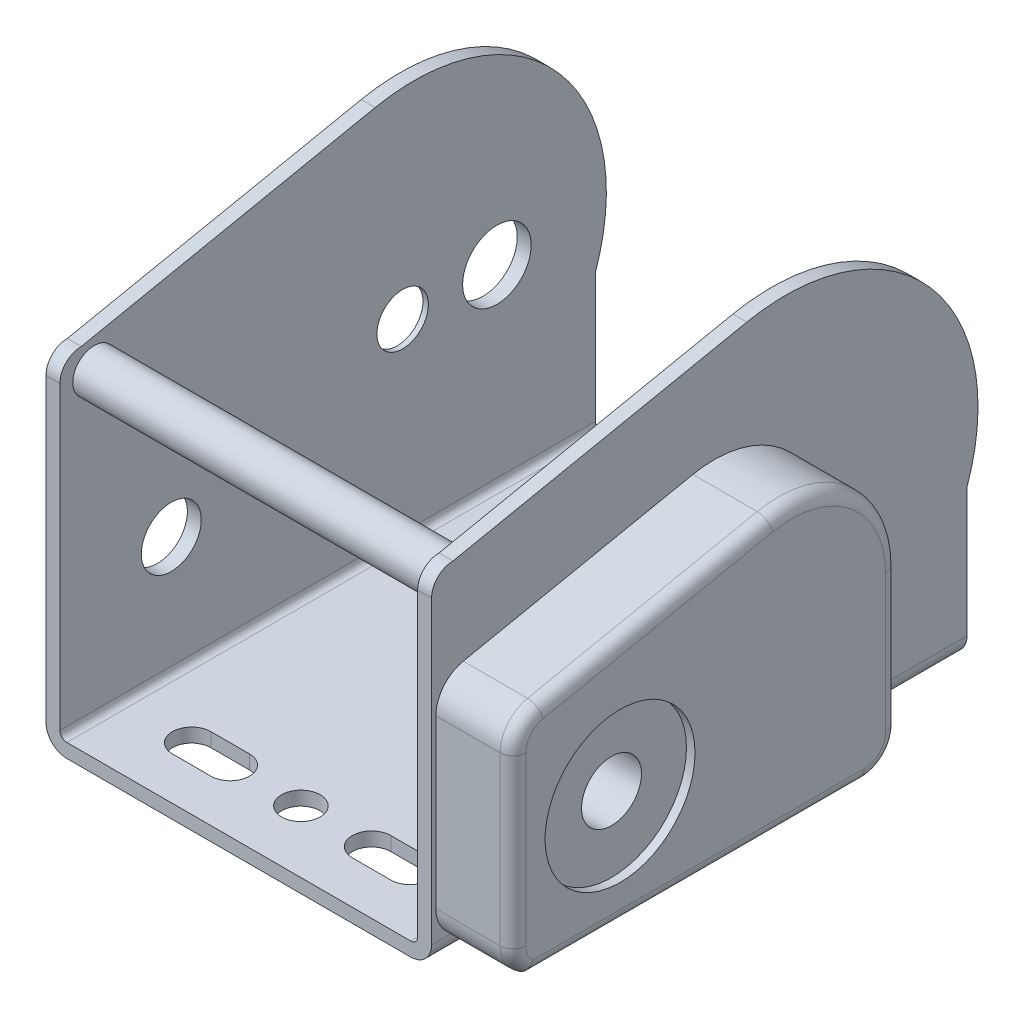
ISO-10303-21;
HEADER;
FILE_DESCRIPTION(('STEP AP214'),'2;1');
FILE_NAME('part.step','',(''),(''),'','','');
FILE_SCHEMA(('AUTOMOTIVE_DESIGN { 1 0 10303 214 1 1 1 1 }'));
ENDSEC;
DATA;
#1=APPLICATION_CONTEXT('core data for automotive mechanical design processes');
#2=APPLICATION_PROTOCOL_DEFINITION('international standard','automotive_design',2000,#1);
#3=PRODUCT_CONTEXT('',#1,'mechanical');
#4=PRODUCT('Part','Part','',(#3));
#5=PRODUCT_RELATED_PRODUCT_CATEGORY('part','',(#4));
#6=PRODUCT_DEFINITION_FORMATION('','',#4);
#7=PRODUCT_DEFINITION_CONTEXT('part definition',#1,'design');
#8=PRODUCT_DEFINITION('design','',#6,#7);
#9=PRODUCT_DEFINITION_SHAPE('','',#8);
#10=(LENGTH_UNIT() NAMED_UNIT(*) SI_UNIT(.MILLI.,.METRE.));
#11=(NAMED_UNIT(*) PLANE_ANGLE_UNIT() SI_UNIT($,.RADIAN.));
#12=(NAMED_UNIT(*) SI_UNIT($,.STERADIAN.) SOLID_ANGLE_UNIT());
#13=UNCERTAINTY_MEASURE_WITH_UNIT(LENGTH_MEASURE(1.E-05),#10,'distance_accuracy_value','');
#14=(GEOMETRIC_REPRESENTATION_CONTEXT(3) GLOBAL_UNCERTAINTY_ASSIGNED_CONTEXT((#13)) GLOBAL_UNIT_ASSIGNED_CONTEXT((#10,
#11,#12)) REPRESENTATION_CONTEXT('',''));
#15=CARTESIAN_POINT('',(0.,0.,0.));
#16=DIRECTION('',(0.,0.,1.));
#17=DIRECTION('',(1.,0.,0.));
#18=AXIS2_PLACEMENT_3D('',#15,#16,#17);
#19=CARTESIAN_POINT('',(0.,-94.9999999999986,0.));
#20=DIRECTION('',(0.,1.,0.));
#21=DIRECTION('',(0.,0.,1.));
#22=AXIS2_PLACEMENT_3D('',#19,#20,#21);
#23=PLANE('',#22);
#24=DIRECTION('',(1.,0.,0.));
#25=VECTOR('',#24,1.);
#26=CARTESIAN_POINT('',(86.75,-94.9999999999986,4.99999999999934));
#27=LINE('',#26,#25);
#28=CARTESIAN_POINT('',(4.875,-94.9999999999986,4.99999999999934));
#29=VERTEX_POINT('',#28);
#30=CARTESIAN_POINT('',(85.125,-94.9999999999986,4.99999999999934));
#31=VERTEX_POINT('',#30);
#32=EDGE_CURVE('E770',#29,#31,#27,.T.);
#33=ORIENTED_EDGE('',*,*,#32,.T.);
#34=DIRECTION('',(0.,0.,-1.));
#35=VECTOR('',#34,1.);
#36=CARTESIAN_POINT('',(85.125,-94.9999999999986,0.));
#37=LINE('',#36,#35);
#38=CARTESIAN_POINT('',(85.125,-94.9999999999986,129.999999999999));
#39=VERTEX_POINT('',#38);
#40=EDGE_CURVE('E816',#31,#39,#37,.F.);
#41=ORIENTED_EDGE('',*,*,#40,.T.);
#42=DIRECTION('',(-1.,0.,0.));
#43=VECTOR('',#42,1.);
#44=CARTESIAN_POINT('',(0.,-94.9999999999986,129.999999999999));
#45=LINE('',#44,#43);
#46=CARTESIAN_POINT('',(4.875,-94.9999999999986,129.999999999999));
#47=VERTEX_POINT('',#46);
#48=EDGE_CURVE('E733',#39,#47,#45,.T.);
#49=ORIENTED_EDGE('',*,*,#48,.T.);
#50=DIRECTION('',(0.,0.,-1.));
#51=VECTOR('',#50,1.);
#52=CARTESIAN_POINT('',(4.875,-94.9999999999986,4.99999999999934));
#53=LINE('',#52,#51);
#54=EDGE_CURVE('E813',#47,#29,#53,.T.);
#55=ORIENTED_EDGE('',*,*,#54,.T.);
#56=EDGE_LOOP('',(#33,#41,#49,#55));
#57=FACE_BOUND('',#56,.T.);
#58=DIRECTION('',(1.,0.,0.));
#59=VECTOR('',#58,1.);
#60=CARTESIAN_POINT('',(19.5,-94.9999999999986,111.));
#61=LINE('',#60,#59);
#62=CARTESIAN_POINT('',(19.5,-94.9999999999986,111.));
#63=VERTEX_POINT('',#62);
#64=CARTESIAN_POINT('',(28.5,-94.9999999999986,111.));
#65=VERTEX_POINT('',#64);
#66=EDGE_CURVE('E432',#63,#65,#61,.T.);
#67=ORIENTED_EDGE('',*,*,#66,.F.);
#68=CARTESIAN_POINT('',(19.5,-94.9999999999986,115.5));
#69=DIRECTION('',(0.,-1.,0.));
#70=DIRECTION('',(0.,0.,-1.));
#71=AXIS2_PLACEMENT_3D('',#68,#69,#70);
#72=CIRCLE('',#71,4.5);
#73=CARTESIAN_POINT('',(19.5,-94.9999999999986,120.));
#74=VERTEX_POINT('',#73);
#75=EDGE_CURVE('E424',#74,#63,#72,.T.);
#76=ORIENTED_EDGE('',*,*,#75,.F.);
#77=DIRECTION('',(-1.,0.,0.));
#78=VECTOR('',#77,1.);
#79=CARTESIAN_POINT('',(28.5,-94.9999999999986,120.));
#80=LINE('',#79,#78);
#81=CARTESIAN_POINT('',(28.5,-94.9999999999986,120.));
#82=VERTEX_POINT('',#81);
#83=EDGE_CURVE('E438',#82,#74,#80,.T.);
#84=ORIENTED_EDGE('',*,*,#83,.F.);
#85=CARTESIAN_POINT('',(28.5,-94.9999999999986,115.5));
#86=DIRECTION('',(0.,-1.,0.));
#87=DIRECTION('',(0.,0.,-1.));
#88=AXIS2_PLACEMENT_3D('',#85,#86,#87);
#89=CIRCLE('',#88,4.5);
#90=EDGE_CURVE('E435',#65,#82,#89,.T.);
#91=ORIENTED_EDGE('',*,*,#90,.F.);
#92=EDGE_LOOP('',(#67,#76,#84,#91));
#93=FACE_BOUND('',#92,.T.);
#94=DIRECTION('',(1.,0.,0.));
#95=VECTOR('',#94,1.);
#96=CARTESIAN_POINT('',(61.5,-94.9999999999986,111.));
#97=LINE('',#96,#95);
#98=CARTESIAN_POINT('',(61.5,-94.9999999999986,111.));
#99=VERTEX_POINT('',#98);
#100=CARTESIAN_POINT('',(70.5,-94.9999999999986,111.));
#101=VERTEX_POINT('',#100);
#102=EDGE_CURVE('E412',#99,#101,#97,.T.);
#103=ORIENTED_EDGE('',*,*,#102,.F.);
#104=CARTESIAN_POINT('',(61.5,-94.9999999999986,115.5));
#105=DIRECTION('',(0.,-1.,0.));
#106=DIRECTION('',(0.,0.,-1.));
#107=AXIS2_PLACEMENT_3D('',#104,#105,#106);
#108=CIRCLE('',#107,4.5);
#109=CARTESIAN_POINT('',(61.5,-94.9999999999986,120.));
#110=VERTEX_POINT('',#109);
#111=EDGE_CURVE('E404',#110,#99,#108,.T.);
#112=ORIENTED_EDGE('',*,*,#111,.F.);
#113=DIRECTION('',(-1.,0.,0.));
#114=VECTOR('',#113,1.);
#115=CARTESIAN_POINT('',(70.5,-94.9999999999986,120.));
#116=LINE('',#115,#114);
#117=CARTESIAN_POINT('',(70.5,-94.9999999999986,120.));
#118=VERTEX_POINT('',#117);
#119=EDGE_CURVE('E418',#118,#110,#116,.T.);
#120=ORIENTED_EDGE('',*,*,#119,.F.);
#121=CARTESIAN_POINT('',(70.5,-94.9999999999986,115.5));
#122=DIRECTION('',(0.,-1.,0.));
#123=DIRECTION('',(0.,0.,-1.));
#124=AXIS2_PLACEMENT_3D('',#121,#122,#123);
#125=CIRCLE('',#124,4.5);
#126=EDGE_CURVE('E415',#101,#118,#125,.T.);
#127=ORIENTED_EDGE('',*,*,#126,.F.);
#128=EDGE_LOOP('',(#103,#112,#120,#127));
#129=FACE_BOUND('',#128,.T.);
#130=DIRECTION('',(0.,0.,-1.));
#131=VECTOR('',#130,1.);
#132=CARTESIAN_POINT('',(40.5,-94.9999999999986,58.5));
#133=LINE('',#132,#131);
#134=CARTESIAN_POINT('',(40.5,-94.9999999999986,58.5));
#135=VERTEX_POINT('',#134);
#136=CARTESIAN_POINT('',(40.5,-94.9999999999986,51.5));
#137=VERTEX_POINT('',#136);
#138=EDGE_CURVE('E392',#135,#137,#133,.T.);
#139=ORIENTED_EDGE('',*,*,#138,.F.);
#140=CARTESIAN_POINT('',(45.,-94.9999999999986,58.5));
#141=DIRECTION('',(0.,-1.,0.));
#142=DIRECTION('',(0.,0.,-1.));
#143=AXIS2_PLACEMENT_3D('',#140,#141,#142);
#144=CIRCLE('',#143,4.5);
#145=CARTESIAN_POINT('',(49.5,-94.9999999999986,58.5));
#146=VERTEX_POINT('',#145);
#147=EDGE_CURVE('E384',#146,#135,#144,.T.);
#148=ORIENTED_EDGE('',*,*,#147,.F.);
#149=DIRECTION('',(0.,0.,1.));
#150=VECTOR('',#149,1.);
#151=CARTESIAN_POINT('',(49.5,-94.9999999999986,51.5));
#152=LINE('',#151,#150);
#153=CARTESIAN_POINT('',(49.5,-94.9999999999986,51.5));
#154=VERTEX_POINT('',#153);
#155=EDGE_CURVE('E398',#154,#146,#152,.T.);
#156=ORIENTED_EDGE('',*,*,#155,.F.);
#157=CARTESIAN_POINT('',(45.,-94.9999999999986,51.5));
#158=DIRECTION('',(0.,-1.,0.));
#159=DIRECTION('',(0.,0.,-1.));
#160=AXIS2_PLACEMENT_3D('',#157,#158,#159);
#161=CIRCLE('',#160,4.5);
#162=EDGE_CURVE('E395',#137,#154,#161,.T.);
#163=ORIENTED_EDGE('',*,*,#162,.F.);
#164=EDGE_LOOP('',(#139,#148,#156,#163));
#165=FACE_BOUND('',#164,.T.);
#166=DIRECTION('',(0.,0.,1.));
#167=VECTOR('',#166,1.);
#168=CARTESIAN_POINT('',(40.5,-95.,16.5));
#169=LINE('',#168,#167);
#170=CARTESIAN_POINT('',(40.5,-95.,16.5));
#171=VERTEX_POINT('',#170);
#172=CARTESIAN_POINT('',(40.5,-95.,28.5));
#173=VERTEX_POINT('',#172);
#174=EDGE_CURVE('E369',#171,#173,#169,.T.);
#175=ORIENTED_EDGE('',*,*,#174,.T.);
#176=CARTESIAN_POINT('',(45.,-95.,28.5));
#177=DIRECTION('',(0.,1.,0.));
#178=DIRECTION('',(0.,0.,1.));
#179=AXIS2_PLACEMENT_3D('',#176,#177,#178);
#180=CIRCLE('',#179,4.5);
#181=CARTESIAN_POINT('',(49.5,-95.,28.5));
#182=VERTEX_POINT('',#181);
#183=EDGE_CURVE('E359',#173,#182,#180,.T.);
#184=ORIENTED_EDGE('',*,*,#183,.T.);
#185=DIRECTION('',(0.,0.,-1.));
#186=VECTOR('',#185,1.);
#187=CARTESIAN_POINT('',(49.5,-95.,28.5));
#188=LINE('',#187,#186);
#189=CARTESIAN_POINT('',(49.5,-94.9999999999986,16.5));
#190=VERTEX_POINT('',#189);
#191=EDGE_CURVE('E362',#182,#190,#188,.T.);
#192=ORIENTED_EDGE('',*,*,#191,.T.);
#193=CARTESIAN_POINT('',(45.,-95.,16.5));
#194=DIRECTION('',(0.,1.,0.));
#195=DIRECTION('',(0.,0.,1.));
#196=AXIS2_PLACEMENT_3D('',#193,#194,#195);
#197=CIRCLE('',#196,4.5);
#198=EDGE_CURVE('E366',#190,#171,#197,.T.);
#199=ORIENTED_EDGE('',*,*,#198,.T.);
#200=EDGE_LOOP('',(#175,#184,#192,#199));
#201=FACE_BOUND('',#200,.T.);
#202=CARTESIAN_POINT('',(45.,-94.9999999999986,115.5));
#203=DIRECTION('',(0.,-1.,0.));
#204=DIRECTION('',(0.,0.,-1.));
#205=AXIS2_PLACEMENT_3D('',#202,#203,#204);
#206=CIRCLE('',#205,4.49999999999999);
#207=CARTESIAN_POINT('',(45.,-94.9999999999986,111.));
#208=VERTEX_POINT('',#207);
#209=EDGE_CURVE('E1261',#208,#208,#206,.T.);
#210=ORIENTED_EDGE('',*,*,#209,.F.);
#211=EDGE_LOOP('',(#210));
#212=FACE_BOUND('',#211,.T.);
#213=ADVANCED_FACE('F39',(#57,#93,#129,#165,#201,#212),#23,.F.);
#214=CARTESIAN_POINT('',(0.,-45.0638748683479,47.4197864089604));
#215=DIRECTION('',(-1.,0.,0.));
#216=DIRECTION('',(0.,0.,1.));
#217=AXIS2_PLACEMENT_3D('',#214,#215,#216);
#218=PLANE('',#217);
#219=CARTESIAN_POINT('',(0.,-47.,28.));
#220=DIRECTION('',(-1.,0.,0.));
#221=DIRECTION('',(0.,0.,1.));
#222=AXIS2_PLACEMENT_3D('',#219,#220,#221);
#223=CIRCLE('',#222,7.99999999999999);
#224=CARTESIAN_POINT('',(0.,-47.,36.));
#225=VERTEX_POINT('',#224);
#226=EDGE_CURVE('E1278',#225,#225,#223,.T.);
#227=ORIENTED_EDGE('',*,*,#226,.F.);
#228=EDGE_LOOP('',(#227));
#229=FACE_BOUND('',#228,.T.);
#230=CARTESIAN_POINT('',(0.,-64.,104.));
#231=DIRECTION('',(-1.,0.,0.));
#232=DIRECTION('',(0.,0.,1.));
#233=AXIS2_PLACEMENT_3D('',#230,#231,#232);
#234=CIRCLE('',#233,6.99999999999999);
#235=CARTESIAN_POINT('',(0.,-64.,111.));
#236=VERTEX_POINT('',#235);
#237=EDGE_CURVE('E1284',#236,#236,#234,.T.);
#238=ORIENTED_EDGE('',*,*,#237,.F.);
#239=EDGE_LOOP('',(#238));
#240=FACE_BOUND('',#239,.T.);
#241=DIRECTION('',(0.,1.,0.));
#242=VECTOR('',#241,1.);
#243=CARTESIAN_POINT('',(0.,-94.9999999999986,4.99999999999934));
#244=LINE('',#243,#242);
#245=CARTESIAN_POINT('',(0.,-90.1249999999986,4.99999999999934));
#246=VERTEX_POINT('',#245);
#247=CARTESIAN_POINT('',(0.,-60.0000000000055,4.99999999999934));
#248=VERTEX_POINT('',#247);
#249=EDGE_CURVE('E758',#246,#248,#244,.T.);
#250=ORIENTED_EDGE('',*,*,#249,.F.);
#251=DIRECTION('',(0.,0.,-1.));
#252=VECTOR('',#251,1.);
#253=CARTESIAN_POINT('',(0.,-90.1249999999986,129.999999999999));
#254=LINE('',#253,#252);
#255=CARTESIAN_POINT('',(0.,-90.1249999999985,130.));
#256=VERTEX_POINT('',#255);
#257=EDGE_CURVE('E11',#246,#256,#254,.F.);
#258=ORIENTED_EDGE('',*,*,#257,.T.);
#259=DIRECTION('',(0.,1.,0.));
#260=VECTOR('',#259,1.);
#261=CARTESIAN_POINT('',(0.,-60.000000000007,130.));
#262=LINE('',#261,#260);
#263=CARTESIAN_POINT('',(0.,-20.,130.));
#264=VERTEX_POINT('',#263);
#265=EDGE_CURVE('E757',#256,#264,#262,.T.);
#266=ORIENTED_EDGE('',*,*,#265,.T.);
#267=CARTESIAN_POINT('',(0.,-20.,125.));
#268=DIRECTION('',(-1.,0.,0.));
#269=DIRECTION('',(0.,0.,1.));
#270=AXIS2_PLACEMENT_3D('',#267,#268,#269);
#271=CIRCLE('',#270,5.);
#272=CARTESIAN_POINT('',(0.,-15.,125.));
#273=VERTEX_POINT('',#272);
#274=EDGE_CURVE('E745',#264,#273,#271,.T.);
#275=ORIENTED_EDGE('',*,*,#274,.T.);
#276=DIRECTION('',(0.,0.19999999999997,-0.979795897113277));
#277=VECTOR('',#276,1.);
#278=CARTESIAN_POINT('',(0.,-15.,125.));
#279=LINE('',#278,#277);
#280=CARTESIAN_POINT('',(0.,-1.00000000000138,56.414287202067));
#281=VERTEX_POINT('',#280);
#282=EDGE_CURVE('E761',#273,#281,#279,.T.);
#283=ORIENTED_EDGE('',*,*,#282,.T.);
#284=CARTESIAN_POINT('',(0.,-45.0638748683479,47.4197864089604));
#285=DIRECTION('',(-1.,0.,0.));
#286=DIRECTION('',(0.,0.,1.));
#287=AXIS2_PLACEMENT_3D('',#284,#285,#286);
#288=CIRCLE('',#287,44.9725039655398);
#289=EDGE_CURVE('E754',#281,#248,#288,.T.);
#290=ORIENTED_EDGE('',*,*,#289,.T.);
#291=EDGE_LOOP('',(#250,#258,#266,#275,#283,#290));
#292=FACE_BOUND('',#291,.T.);
#293=CARTESIAN_POINT('',(0.,-47.,50.));
#294=DIRECTION('',(-1.,0.,0.));
#295=DIRECTION('',(0.,0.,1.));
#296=AXIS2_PLACEMENT_3D('',#293,#294,#295);
#297=CIRCLE('',#296,10.0000000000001);
#298=CARTESIAN_POINT('',(0.,-47.,60.0000000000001));
#299=VERTEX_POINT('',#298);
#300=EDGE_CURVE('E1299',#299,#299,#297,.T.);
#301=ORIENTED_EDGE('',*,*,#300,.F.);
#302=EDGE_LOOP('',(#301));
#303=FACE_BOUND('',#302,.T.);
#304=ADVANCED_FACE('F569',(#229,#240,#292,#303),#218,.T.);
#305=CARTESIAN_POINT('',(90.,-20.,125.));
#306=DIRECTION('',(-1.,0.,0.));
#307=DIRECTION('',(0.,0.,1.));
#308=AXIS2_PLACEMENT_3D('',#305,#306,#307);
#309=PLANE('',#308);
#310=DIRECTION('',(0.,-1.,0.));
#311=VECTOR('',#310,1.);
#312=CARTESIAN_POINT('',(90.,-95.,130.));
#313=LINE('',#312,#311);
#314=CARTESIAN_POINT('',(90.,-20.,130.));
#315=VERTEX_POINT('',#314);
#316=CARTESIAN_POINT('',(90.,-90.1249999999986,130.));
#317=VERTEX_POINT('',#316);
#318=EDGE_CURVE('E460',#315,#317,#313,.T.);
#319=ORIENTED_EDGE('',*,*,#318,.T.);
#320=DIRECTION('',(0.,0.,-1.));
#321=VECTOR('',#320,1.);
#322=CARTESIAN_POINT('',(90.,-90.1249999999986,125.));
#323=LINE('',#322,#321);
#324=CARTESIAN_POINT('',(90.,-90.1249999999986,4.99999999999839));
#325=VERTEX_POINT('',#324);
#326=EDGE_CURVE('E516',#317,#325,#323,.T.);
#327=ORIENTED_EDGE('',*,*,#326,.T.);
#328=DIRECTION('',(0.,1.,0.));
#329=VECTOR('',#328,1.);
#330=CARTESIAN_POINT('',(90.,-60.0000000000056,4.9999999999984));
#331=LINE('',#330,#329);
#332=CARTESIAN_POINT('',(90.,-60.0000000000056,4.9999999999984));
#333=VERTEX_POINT('',#332);
#334=EDGE_CURVE('E451',#325,#333,#331,.T.);
#335=ORIENTED_EDGE('',*,*,#334,.T.);
#336=CARTESIAN_POINT('',(90.,-45.063874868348,47.4197864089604));
#337=DIRECTION('',(1.,0.,0.));
#338=DIRECTION('',(0.,0.,1.));
#339=AXIS2_PLACEMENT_3D('',#336,#337,#338);
#340=CIRCLE('',#339,44.9725039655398);
#341=CARTESIAN_POINT('',(90.,-1.00000000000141,56.4142872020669));
#342=VERTEX_POINT('',#341);
#343=EDGE_CURVE('E453',#333,#342,#340,.T.);
#344=ORIENTED_EDGE('',*,*,#343,.T.);
#345=DIRECTION('',(0.,-0.199999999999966,0.979795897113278));
#346=VECTOR('',#345,1.);
#347=CARTESIAN_POINT('',(90.,-14.9999999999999,125.));
#348=LINE('',#347,#346);
#349=CARTESIAN_POINT('',(90.,-14.9999999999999,125.));
#350=VERTEX_POINT('',#349);
#351=EDGE_CURVE('E456',#342,#350,#348,.T.);
#352=ORIENTED_EDGE('',*,*,#351,.T.);
#353=CARTESIAN_POINT('',(90.,-20.,125.));
#354=DIRECTION('',(1.,0.,0.));
#355=DIRECTION('',(0.,0.,1.));
#356=AXIS2_PLACEMENT_3D('',#353,#354,#355);
#357=CIRCLE('',#356,5.00000000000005);
#358=EDGE_CURVE('E458',#350,#315,#357,.T.);
#359=ORIENTED_EDGE('',*,*,#358,.T.);
#360=EDGE_LOOP('',(#319,#327,#335,#344,#352,#359));
#361=FACE_BOUND('',#360,.T.);
#362=CARTESIAN_POINT('',(90.,-83.28629286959,121.000000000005));
#363=DIRECTION('',(1.,0.,0.));
#364=DIRECTION('',(0.,0.,1.));
#365=AXIS2_PLACEMENT_3D('',#362,#363,#364);
#366=CIRCLE('',#365,7.99999999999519);
#367=CARTESIAN_POINT('',(90.,-83.28629286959,129.));
#368=VERTEX_POINT('',#367);
#369=CARTESIAN_POINT('',(90.,-90.000000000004,125.350417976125));
#370=VERTEX_POINT('',#369);
#371=EDGE_CURVE('E325',#368,#370,#366,.T.);
#372=ORIENTED_EDGE('',*,*,#371,.F.);
#373=DIRECTION('',(0.,-1.,0.));
#374=VECTOR('',#373,1.);
#375=CARTESIAN_POINT('',(90.,-83.28629286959,129.));
#376=LINE('',#375,#374);
#377=CARTESIAN_POINT('',(90.,-44.2862928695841,129.));
#378=VERTEX_POINT('',#377);
#379=EDGE_CURVE('E331',#378,#368,#376,.T.);
#380=ORIENTED_EDGE('',*,*,#379,.F.);
#381=CARTESIAN_POINT('',(90.,-44.2862928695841,121.));
#382=DIRECTION('',(-1.,0.,0.));
#383=DIRECTION('',(0.,0.,1.));
#384=AXIS2_PLACEMENT_3D('',#381,#382,#383);
#385=CIRCLE('',#384,8.);
#386=CARTESIAN_POINT('',(90.,-36.4479256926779,122.6));
#387=VERTEX_POINT('',#386);
#388=EDGE_CURVE('E707',#378,#387,#385,.T.);
#389=ORIENTED_EDGE('',*,*,#388,.T.);
#390=DIRECTION('',(0.,0.199999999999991,-0.979795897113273));
#391=VECTOR('',#390,1.);
#392=CARTESIAN_POINT('',(90.,-36.2603106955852,121.680877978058));
#393=LINE('',#392,#391);
#394=CARTESIAN_POINT('',(90.,-25.5068715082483,69.0000000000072));
#395=VERTEX_POINT('',#394);
#396=EDGE_CURVE('E340',#395,#387,#393,.F.);
#397=ORIENTED_EDGE('',*,*,#396,.F.);
#398=CARTESIAN_POINT('',(90.,-50.0017689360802,64.0000000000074));
#399=DIRECTION('',(-1.,0.,0.));
#400=DIRECTION('',(0.,0.,1.));
#401=AXIS2_PLACEMENT_3D('',#398,#399,#400);
#402=CIRCLE('',#401,25.);
#403=CARTESIAN_POINT('',(90.,-50.0017689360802,39.0000000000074));
#404=VERTEX_POINT('',#403);
#405=EDGE_CURVE('E658',#395,#404,#402,.T.);
#406=ORIENTED_EDGE('',*,*,#405,.T.);
#407=DIRECTION('',(0.,1.,0.));
#408=VECTOR('',#407,1.);
#409=CARTESIAN_POINT('',(90.,-19.3831471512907,39.0000000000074));
#410=LINE('',#409,#408);
#411=CARTESIAN_POINT('',(90.,-82.000000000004,39.0000000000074));
#412=VERTEX_POINT('',#411);
#413=EDGE_CURVE('E348',#412,#404,#410,.T.);
#414=ORIENTED_EDGE('',*,*,#413,.F.);
#415=CARTESIAN_POINT('',(90.,-82.000000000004,47.0000000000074));
#416=DIRECTION('',(-1.,0.,0.));
#417=DIRECTION('',(0.,0.,1.));
#418=AXIS2_PLACEMENT_3D('',#415,#416,#417);
#419=CIRCLE('',#418,8.);
#420=CARTESIAN_POINT('',(90.,-90.000000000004,47.0000000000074));
#421=VERTEX_POINT('',#420);
#422=EDGE_CURVE('E709',#412,#421,#419,.T.);
#423=ORIENTED_EDGE('',*,*,#422,.T.);
#424=DIRECTION('',(0.,0.,-1.));
#425=VECTOR('',#424,1.);
#426=CARTESIAN_POINT('',(90.,-90.000000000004,39.0000000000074));
#427=LINE('',#426,#425);
#428=EDGE_CURVE('E345',#370,#421,#427,.T.);
#429=ORIENTED_EDGE('',*,*,#428,.F.);
#430=EDGE_LOOP('',(#372,#380,#389,#397,#406,#414,#423,#429));
#431=FACE_BOUND('',#430,.T.);
#432=ADVANCED_FACE('F343',(#361,#431),#309,.F.);
#433=CARTESIAN_POINT('',(3.25,-45.0638748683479,47.4197864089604));
#434=DIRECTION('',(-1.,0.,0.));
#435=DIRECTION('',(0.,0.,1.));
#436=AXIS2_PLACEMENT_3D('',#433,#434,#435);
#437=CYLINDRICAL_SURFACE('',#436,44.9725039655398);
#438=ORIENTED_EDGE('',*,*,#289,.F.);
#439=DIRECTION('',(-1.,0.,0.));
#440=VECTOR('',#439,1.);
#441=CARTESIAN_POINT('',(3.25,-1.00000000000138,56.414287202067));
#442=LINE('',#441,#440);
#443=CARTESIAN_POINT('',(3.25,-1.00000000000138,56.414287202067));
#444=VERTEX_POINT('',#443);
#445=EDGE_CURVE('E669',#444,#281,#442,.T.);
#446=ORIENTED_EDGE('',*,*,#445,.F.);
#447=CARTESIAN_POINT('',(3.25,-45.0638748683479,47.4197864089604));
#448=DIRECTION('',(-1.,0.,0.));
#449=DIRECTION('',(0.,0.,1.));
#450=AXIS2_PLACEMENT_3D('',#447,#448,#449);
#451=CIRCLE('',#450,44.9725039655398);
#452=CARTESIAN_POINT('',(3.25,-60.0000000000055,5.));
#453=VERTEX_POINT('',#452);
#454=EDGE_CURVE('E740',#444,#453,#451,.T.);
#455=ORIENTED_EDGE('',*,*,#454,.T.);
#456=DIRECTION('',(-1.,0.,0.));
#457=VECTOR('',#456,1.);
#458=CARTESIAN_POINT('',(3.25,-60.0000000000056,4.99999999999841));
#459=LINE('',#458,#457);
#460=EDGE_CURVE('E731',#453,#248,#459,.T.);
#461=ORIENTED_EDGE('',*,*,#460,.T.);
#462=EDGE_LOOP('',(#438,#446,#455,#461));
#463=FACE_BOUND('',#462,.T.);
#464=ADVANCED_FACE('F596',(#463),#437,.T.);
#465=CARTESIAN_POINT('',(3.25,-15.,125.));
#466=DIRECTION('',(0.,0.979795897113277,0.19999999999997));
#467=DIRECTION('',(0.,-0.19999999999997,0.979795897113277));
#468=AXIS2_PLACEMENT_3D('',#465,#466,#467);
#469=PLANE('',#468);
#470=ORIENTED_EDGE('',*,*,#282,.F.);
#471=DIRECTION('',(-1.,0.,0.));
#472=VECTOR('',#471,1.);
#473=CARTESIAN_POINT('',(3.25,-15.,125.));
#474=LINE('',#473,#472);
#475=CARTESIAN_POINT('',(3.25,-15.,125.));
#476=VERTEX_POINT('',#475);
#477=EDGE_CURVE('E746',#476,#273,#474,.T.);
#478=ORIENTED_EDGE('',*,*,#477,.F.);
#479=DIRECTION('',(0.,0.19999999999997,-0.979795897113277));
#480=VECTOR('',#479,1.);
#481=CARTESIAN_POINT('',(3.25,-15.,125.));
#482=LINE('',#481,#480);
#483=EDGE_CURVE('E749',#476,#444,#482,.T.);
#484=ORIENTED_EDGE('',*,*,#483,.T.);
#485=ORIENTED_EDGE('',*,*,#445,.T.);
#486=EDGE_LOOP('',(#470,#478,#484,#485));
#487=FACE_BOUND('',#486,.T.);
#488=ADVANCED_FACE('F592',(#487),#469,.T.);
#489=CARTESIAN_POINT('',(3.25,-20.,125.));
#490=DIRECTION('',(-1.,0.,0.));
#491=DIRECTION('',(0.,0.,1.));
#492=AXIS2_PLACEMENT_3D('',#489,#490,#491);
#493=CYLINDRICAL_SURFACE('',#492,5.);
#494=ORIENTED_EDGE('',*,*,#274,.F.);
#495=DIRECTION('',(-1.,0.,0.));
#496=VECTOR('',#495,1.);
#497=CARTESIAN_POINT('',(3.25,-20.,130.));
#498=LINE('',#497,#496);
#499=CARTESIAN_POINT('',(3.25,-20.,130.));
#500=VERTEX_POINT('',#499);
#501=EDGE_CURVE('E737',#500,#264,#498,.T.);
#502=ORIENTED_EDGE('',*,*,#501,.F.);
#503=CARTESIAN_POINT('',(3.25,-20.,125.));
#504=DIRECTION('',(-1.,0.,0.));
#505=DIRECTION('',(0.,0.,1.));
#506=AXIS2_PLACEMENT_3D('',#503,#504,#505);
#507=CIRCLE('',#506,5.);
#508=EDGE_CURVE('E739',#500,#476,#507,.T.);
#509=ORIENTED_EDGE('',*,*,#508,.T.);
#510=ORIENTED_EDGE('',*,*,#477,.T.);
#511=EDGE_LOOP('',(#494,#502,#509,#510));
#512=FACE_BOUND('',#511,.T.);
#513=ADVANCED_FACE('F595',(#512),#493,.T.);
#514=CARTESIAN_POINT('',(3.25,-60.000000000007,130.));
#515=DIRECTION('',(0.,0.,1.));
#516=DIRECTION('',(1.,0.,0.));
#517=AXIS2_PLACEMENT_3D('',#514,#515,#516);
#518=PLANE('',#517);
#519=ORIENTED_EDGE('',*,*,#48,.F.);
#520=CARTESIAN_POINT('',(85.125,-90.1249999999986,130.));
#521=DIRECTION('',(0.,0.,1.));
#522=DIRECTION('',(1.,0.,0.));
#523=AXIS2_PLACEMENT_3D('',#520,#521,#522);
#524=CIRCLE('',#523,4.875);
#525=EDGE_CURVE('E47',#39,#317,#524,.T.);
#526=ORIENTED_EDGE('',*,*,#525,.T.);
#527=ORIENTED_EDGE('',*,*,#318,.F.);
#528=DIRECTION('',(-1.,0.,0.));
#529=VECTOR('',#528,1.);
#530=CARTESIAN_POINT('',(90.,-20.,130.));
#531=LINE('',#530,#529);
#532=CARTESIAN_POINT('',(86.75,-20.,130.));
#533=VERTEX_POINT('',#532);
#534=EDGE_CURVE('E463',#315,#533,#531,.T.);
#535=ORIENTED_EDGE('',*,*,#534,.T.);
#536=DIRECTION('',(0.,-1.,0.));
#537=VECTOR('',#536,1.);
#538=CARTESIAN_POINT('',(86.75,-95.,130.));
#539=LINE('',#538,#537);
#540=CARTESIAN_POINT('',(86.75,-90.1249999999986,130.));
#541=VERTEX_POINT('',#540);
#542=EDGE_CURVE('E454',#533,#541,#539,.T.);
#543=ORIENTED_EDGE('',*,*,#542,.T.);
#544=CARTESIAN_POINT('',(85.125,-90.1249999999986,130.));
#545=DIRECTION('',(0.,0.,1.));
#546=DIRECTION('',(1.,0.,0.));
#547=AXIS2_PLACEMENT_3D('',#544,#545,#546);
#548=CIRCLE('',#547,1.625);
#549=CARTESIAN_POINT('',(85.125,-91.7499999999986,130.));
#550=VERTEX_POINT('',#549);
#551=EDGE_CURVE('E481',#541,#550,#548,.F.);
#552=ORIENTED_EDGE('',*,*,#551,.T.);
#553=DIRECTION('',(1.,0.,0.));
#554=VECTOR('',#553,1.);
#555=CARTESIAN_POINT('',(3.25,-91.7499999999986,130.));
#556=LINE('',#555,#554);
#557=CARTESIAN_POINT('',(4.875,-91.7499999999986,130.));
#558=VERTEX_POINT('',#557);
#559=EDGE_CURVE('E639',#558,#550,#556,.T.);
#560=ORIENTED_EDGE('',*,*,#559,.F.);
#561=CARTESIAN_POINT('',(4.875,-90.1249999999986,130.));
#562=DIRECTION('',(0.,0.,1.));
#563=DIRECTION('',(1.,0.,0.));
#564=AXIS2_PLACEMENT_3D('',#561,#562,#563);
#565=CIRCLE('',#564,1.625);
#566=CARTESIAN_POINT('',(3.25,-90.1249999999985,130.));
#567=VERTEX_POINT('',#566);
#568=EDGE_CURVE('E475',#558,#567,#565,.F.);
#569=ORIENTED_EDGE('',*,*,#568,.T.);
#570=DIRECTION('',(0.,1.,0.));
#571=VECTOR('',#570,1.);
#572=CARTESIAN_POINT('',(3.25,-60.000000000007,130.));
#573=LINE('',#572,#571);
#574=EDGE_CURVE('E727',#567,#500,#573,.T.);
#575=ORIENTED_EDGE('',*,*,#574,.T.);
#576=ORIENTED_EDGE('',*,*,#501,.T.);
#577=ORIENTED_EDGE('',*,*,#265,.F.);
#578=CARTESIAN_POINT('',(4.875,-90.1249999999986,130.));
#579=DIRECTION('',(0.,0.,1.));
#580=DIRECTION('',(1.,0.,0.));
#581=AXIS2_PLACEMENT_3D('',#578,#579,#580);
#582=CIRCLE('',#581,4.875);
#583=EDGE_CURVE('E59',#256,#47,#582,.T.);
#584=ORIENTED_EDGE('',*,*,#583,.T.);
#585=EDGE_LOOP('',(#519,#526,#527,#535,#543,#552,#560,#569,#575,#576,#577,#584));
#586=FACE_BOUND('',#585,.T.);
#587=ADVANCED_FACE('F589',(#586),#518,.T.);
#588=CARTESIAN_POINT('',(3.25,-45.0638748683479,47.4197864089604));
#589=DIRECTION('',(-1.,0.,0.));
#590=DIRECTION('',(0.,0.,1.));
#591=AXIS2_PLACEMENT_3D('',#588,#589,#590);
#592=PLANE('',#591);
#593=CARTESIAN_POINT('',(3.25,-47.,28.));
#594=DIRECTION('',(-1.,0.,0.));
#595=DIRECTION('',(0.,0.,1.));
#596=AXIS2_PLACEMENT_3D('',#593,#594,#595);
#597=CIRCLE('',#596,8.);
#598=CARTESIAN_POINT('',(3.25,-47.,36.));
#599=VERTEX_POINT('',#598);
#600=EDGE_CURVE('E1281',#599,#599,#597,.T.);
#601=ORIENTED_EDGE('',*,*,#600,.T.);
#602=EDGE_LOOP('',(#601));
#603=FACE_BOUND('',#602,.T.);
#604=CARTESIAN_POINT('',(3.25,-64.,104.));
#605=DIRECTION('',(-1.,0.,0.));
#606=DIRECTION('',(0.,0.,1.));
#607=AXIS2_PLACEMENT_3D('',#604,#605,#606);
#608=CIRCLE('',#607,7.);
#609=CARTESIAN_POINT('',(3.25,-64.,111.));
#610=VERTEX_POINT('',#609);
#611=EDGE_CURVE('E1287',#610,#610,#608,.T.);
#612=ORIENTED_EDGE('',*,*,#611,.T.);
#613=EDGE_LOOP('',(#612));
#614=FACE_BOUND('',#613,.T.);
#615=CARTESIAN_POINT('',(3.25,-47.,50.));
#616=DIRECTION('',(-1.,0.,0.));
#617=DIRECTION('',(0.,0.,1.));
#618=AXIS2_PLACEMENT_3D('',#615,#616,#617);
#619=CIRCLE('',#618,6.);
#620=CARTESIAN_POINT('',(3.25,-47.,56.));
#621=VERTEX_POINT('',#620);
#622=EDGE_CURVE('E1296',#621,#621,#619,.T.);
#623=ORIENTED_EDGE('',*,*,#622,.T.);
#624=EDGE_LOOP('',(#623));
#625=FACE_BOUND('',#624,.T.);
#626=CARTESIAN_POINT('',(3.25,-21.32455532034,122.));
#627=DIRECTION('',(-1.,0.,0.));
#628=DIRECTION('',(0.,0.,1.));
#629=AXIS2_PLACEMENT_3D('',#626,#627,#628);
#630=CIRCLE('',#629,5.);
#631=CARTESIAN_POINT('',(3.25,-21.32455532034,127.));
#632=VERTEX_POINT('',#631);
#633=EDGE_CURVE('E346',#632,#632,#630,.T.);
#634=ORIENTED_EDGE('',*,*,#633,.T.);
#635=EDGE_LOOP('',(#634));
#636=FACE_BOUND('',#635,.T.);
#637=ORIENTED_EDGE('',*,*,#574,.F.);
#638=DIRECTION('',(0.,0.,1.));
#639=VECTOR('',#638,1.);
#640=CARTESIAN_POINT('',(3.25,-90.1249999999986,47.4197864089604));
#641=LINE('',#640,#639);
#642=CARTESIAN_POINT('',(3.25,-90.1249999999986,5.));
#643=VERTEX_POINT('',#642);
#644=EDGE_CURVE('E471',#567,#643,#641,.F.);
#645=ORIENTED_EDGE('',*,*,#644,.T.);
#646=DIRECTION('',(0.,1.,0.));
#647=VECTOR('',#646,1.);
#648=CARTESIAN_POINT('',(3.25,-91.7499999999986,5.));
#649=LINE('',#648,#647);
#650=EDGE_CURVE('E651',#643,#453,#649,.T.);
#651=ORIENTED_EDGE('',*,*,#650,.T.);
#652=ORIENTED_EDGE('',*,*,#454,.F.);
#653=ORIENTED_EDGE('',*,*,#483,.F.);
#654=ORIENTED_EDGE('',*,*,#508,.F.);
#655=EDGE_LOOP('',(#637,#645,#651,#652,#653,#654));
#656=FACE_BOUND('',#655,.T.);
#657=ADVANCED_FACE('F586',(#603,#614,#625,#636,#656),#592,.F.);
#658=CARTESIAN_POINT('',(86.75,-94.9999999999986,4.99999999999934));
#659=DIRECTION('',(0.,0.,1.));
#660=DIRECTION('',(1.,0.,0.));
#661=AXIS2_PLACEMENT_3D('',#658,#659,#660);
#662=PLANE('',#661);
#663=ORIENTED_EDGE('',*,*,#334,.F.);
#664=CARTESIAN_POINT('',(85.125,-90.1249999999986,4.99999999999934));
#665=DIRECTION('',(0.,0.,1.));
#666=DIRECTION('',(1.,0.,0.));
#667=AXIS2_PLACEMENT_3D('',#664,#665,#666);
#668=CIRCLE('',#667,4.875);
#669=EDGE_CURVE('E800',#325,#31,#668,.F.);
#670=ORIENTED_EDGE('',*,*,#669,.T.);
#671=ORIENTED_EDGE('',*,*,#32,.F.);
#672=CARTESIAN_POINT('',(4.875,-90.1249999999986,4.99999999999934));
#673=DIRECTION('',(0.,0.,1.));
#674=DIRECTION('',(1.,0.,0.));
#675=AXIS2_PLACEMENT_3D('',#672,#673,#674);
#676=CIRCLE('',#675,4.875);
#677=EDGE_CURVE('E805',#29,#246,#676,.F.);
#678=ORIENTED_EDGE('',*,*,#677,.T.);
#679=ORIENTED_EDGE('',*,*,#249,.T.);
#680=ORIENTED_EDGE('',*,*,#460,.F.);
#681=ORIENTED_EDGE('',*,*,#650,.F.);
#682=CARTESIAN_POINT('',(4.875,-90.1249999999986,4.99999999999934));
#683=DIRECTION('',(0.,0.,1.));
#684=DIRECTION('',(1.,0.,0.));
#685=AXIS2_PLACEMENT_3D('',#682,#683,#684);
#686=CIRCLE('',#685,1.625);
#687=CARTESIAN_POINT('',(4.87500000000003,-91.7499999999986,5.));
#688=VERTEX_POINT('',#687);
#689=EDGE_CURVE('E477',#643,#688,#686,.T.);
#690=ORIENTED_EDGE('',*,*,#689,.T.);
#691=DIRECTION('',(-1.,0.,0.));
#692=VECTOR('',#691,1.);
#693=CARTESIAN_POINT('',(86.75,-91.7499999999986,5.));
#694=LINE('',#693,#692);
#695=CARTESIAN_POINT('',(85.125,-91.7499999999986,5.));
#696=VERTEX_POINT('',#695);
#697=EDGE_CURVE('E648',#696,#688,#694,.T.);
#698=ORIENTED_EDGE('',*,*,#697,.F.);
#699=CARTESIAN_POINT('',(85.125,-90.1249999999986,4.99999999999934));
#700=DIRECTION('',(0.,0.,1.));
#701=DIRECTION('',(1.,0.,0.));
#702=AXIS2_PLACEMENT_3D('',#699,#700,#701);
#703=CIRCLE('',#702,1.625);
#704=CARTESIAN_POINT('',(86.75,-90.1249999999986,4.99999999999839));
#705=VERTEX_POINT('',#704);
#706=EDGE_CURVE('E479',#696,#705,#703,.T.);
#707=ORIENTED_EDGE('',*,*,#706,.T.);
#708=DIRECTION('',(0.,1.,0.));
#709=VECTOR('',#708,1.);
#710=CARTESIAN_POINT('',(86.75,-60.0000000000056,4.9999999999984));
#711=LINE('',#710,#709);
#712=CARTESIAN_POINT('',(86.75,-60.0000000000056,4.9999999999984));
#713=VERTEX_POINT('',#712);
#714=EDGE_CURVE('E444',#705,#713,#711,.T.);
#715=ORIENTED_EDGE('',*,*,#714,.T.);
#716=DIRECTION('',(-1.,0.,0.));
#717=VECTOR('',#716,1.);
#718=CARTESIAN_POINT('',(90.,-60.0000000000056,4.9999999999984));
#719=LINE('',#718,#717);
#720=EDGE_CURVE('E649',#333,#713,#719,.T.);
#721=ORIENTED_EDGE('',*,*,#720,.F.);
#722=EDGE_LOOP('',(#663,#670,#671,#678,#679,#680,#681,#690,#698,#707,#715,#721));
#723=FACE_BOUND('',#722,.T.);
#724=ADVANCED_FACE('F583',(#723),#662,.F.);
#725=CARTESIAN_POINT('',(0.,-91.7499999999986,0.));
#726=DIRECTION('',(0.,1.,0.));
#727=DIRECTION('',(0.,0.,1.));
#728=AXIS2_PLACEMENT_3D('',#725,#726,#727);
#729=PLANE('',#728);
#730=CARTESIAN_POINT('',(45.,-91.7499999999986,115.5));
#731=DIRECTION('',(0.,1.,0.));
#732=DIRECTION('',(0.,0.,1.));
#733=AXIS2_PLACEMENT_3D('',#730,#731,#732);
#734=CIRCLE('',#733,4.5);
#735=CARTESIAN_POINT('',(45.,-91.7499999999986,120.));
#736=VERTEX_POINT('',#735);
#737=EDGE_CURVE('E1264',#736,#736,#734,.T.);
#738=ORIENTED_EDGE('',*,*,#737,.F.);
#739=EDGE_LOOP('',(#738));
#740=FACE_BOUND('',#739,.T.);
#741=CARTESIAN_POINT('',(45.,-91.7499999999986,28.5));
#742=DIRECTION('',(0.,1.,0.));
#743=DIRECTION('',(0.,0.,1.));
#744=AXIS2_PLACEMENT_3D('',#741,#742,#743);
#745=CIRCLE('',#744,4.5);
#746=CARTESIAN_POINT('',(40.5,-91.7499999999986,28.5));
#747=VERTEX_POINT('',#746);
#748=CARTESIAN_POINT('',(49.5,-91.7499999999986,28.5));
#749=VERTEX_POINT('',#748);
#750=EDGE_CURVE('E358',#747,#749,#745,.T.);
#751=ORIENTED_EDGE('',*,*,#750,.F.);
#752=DIRECTION('',(0.,0.,1.));
#753=VECTOR('',#752,1.);
#754=CARTESIAN_POINT('',(40.5,-91.7499999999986,16.5));
#755=LINE('',#754,#753);
#756=CARTESIAN_POINT('',(40.5,-91.7499999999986,16.5));
#757=VERTEX_POINT('',#756);
#758=EDGE_CURVE('E363',#757,#747,#755,.T.);
#759=ORIENTED_EDGE('',*,*,#758,.F.);
#760=CARTESIAN_POINT('',(45.,-91.7499999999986,16.5));
#761=DIRECTION('',(0.,1.,0.));
#762=DIRECTION('',(0.,0.,1.));
#763=AXIS2_PLACEMENT_3D('',#760,#761,#762);
#764=CIRCLE('',#763,4.5);
#765=CARTESIAN_POINT('',(49.5,-91.7499999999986,16.5));
#766=VERTEX_POINT('',#765);
#767=EDGE_CURVE('E377',#766,#757,#764,.T.);
#768=ORIENTED_EDGE('',*,*,#767,.F.);
#769=DIRECTION('',(0.,0.,-1.));
#770=VECTOR('',#769,1.);
#771=CARTESIAN_POINT('',(49.5,-91.7499999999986,28.5));
#772=LINE('',#771,#770);
#773=EDGE_CURVE('E374',#749,#766,#772,.T.);
#774=ORIENTED_EDGE('',*,*,#773,.F.);
#775=EDGE_LOOP('',(#751,#759,#768,#774));
#776=FACE_BOUND('',#775,.T.);
#777=CARTESIAN_POINT('',(45.,-91.7499999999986,58.5));
#778=DIRECTION('',(0.,1.,0.));
#779=DIRECTION('',(0.,0.,1.));
#780=AXIS2_PLACEMENT_3D('',#777,#778,#779);
#781=CIRCLE('',#780,4.5);
#782=CARTESIAN_POINT('',(40.5,-91.7499999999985,58.5));
#783=VERTEX_POINT('',#782);
#784=CARTESIAN_POINT('',(49.5,-91.7499999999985,58.5));
#785=VERTEX_POINT('',#784);
#786=EDGE_CURVE('E692',#783,#785,#781,.T.);
#787=ORIENTED_EDGE('',*,*,#786,.F.);
#788=DIRECTION('',(0.,0.,1.));
#789=VECTOR('',#788,1.);
#790=CARTESIAN_POINT('',(40.4999999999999,-91.7499999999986,0.));
#791=LINE('',#790,#789);
#792=CARTESIAN_POINT('',(40.5,-91.7499999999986,51.5));
#793=VERTEX_POINT('',#792);
#794=EDGE_CURVE('E685',#793,#783,#791,.T.);
#795=ORIENTED_EDGE('',*,*,#794,.F.);
#796=CARTESIAN_POINT('',(45.,-91.7499999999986,51.5));
#797=DIRECTION('',(0.,1.,0.));
#798=DIRECTION('',(0.,0.,1.));
#799=AXIS2_PLACEMENT_3D('',#796,#797,#798);
#800=CIRCLE('',#799,4.5);
#801=CARTESIAN_POINT('',(49.5,-91.7499999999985,51.5));
#802=VERTEX_POINT('',#801);
#803=EDGE_CURVE('E687',#802,#793,#800,.T.);
#804=ORIENTED_EDGE('',*,*,#803,.F.);
#805=DIRECTION('',(0.,0.,-1.));
#806=VECTOR('',#805,1.);
#807=CARTESIAN_POINT('',(49.5,-91.7499999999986,0.));
#808=LINE('',#807,#806);
#809=EDGE_CURVE('E690',#785,#802,#808,.T.);
#810=ORIENTED_EDGE('',*,*,#809,.F.);
#811=EDGE_LOOP('',(#787,#795,#804,#810));
#812=FACE_BOUND('',#811,.T.);
#813=CARTESIAN_POINT('',(61.5,-91.7499999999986,115.5));
#814=DIRECTION('',(0.,1.,0.));
#815=DIRECTION('',(0.,0.,1.));
#816=AXIS2_PLACEMENT_3D('',#813,#814,#815);
#817=CIRCLE('',#816,4.5);
#818=CARTESIAN_POINT('',(61.5,-91.7499999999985,111.));
#819=VERTEX_POINT('',#818);
#820=CARTESIAN_POINT('',(61.5,-91.7499999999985,120.));
#821=VERTEX_POINT('',#820);
#822=EDGE_CURVE('E683',#819,#821,#817,.T.);
#823=ORIENTED_EDGE('',*,*,#822,.F.);
#824=DIRECTION('',(-1.,0.,0.));
#825=VECTOR('',#824,1.);
#826=CARTESIAN_POINT('',(0.,-91.7499999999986,111.));
#827=LINE('',#826,#825);
#828=CARTESIAN_POINT('',(70.5,-91.7499999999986,111.));
#829=VERTEX_POINT('',#828);
#830=EDGE_CURVE('E676',#829,#819,#827,.T.);
#831=ORIENTED_EDGE('',*,*,#830,.F.);
#832=CARTESIAN_POINT('',(70.5,-91.7499999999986,115.5));
#833=DIRECTION('',(0.,1.,0.));
#834=DIRECTION('',(0.,0.,1.));
#835=AXIS2_PLACEMENT_3D('',#832,#833,#834);
#836=CIRCLE('',#835,4.5);
#837=CARTESIAN_POINT('',(70.5,-91.7499999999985,120.));
#838=VERTEX_POINT('',#837);
#839=EDGE_CURVE('E678',#838,#829,#836,.T.);
#840=ORIENTED_EDGE('',*,*,#839,.F.);
#841=DIRECTION('',(1.,0.,0.));
#842=VECTOR('',#841,1.);
#843=CARTESIAN_POINT('',(0.,-91.7499999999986,120.));
#844=LINE('',#843,#842);
#845=EDGE_CURVE('E681',#821,#838,#844,.T.);
#846=ORIENTED_EDGE('',*,*,#845,.F.);
#847=EDGE_LOOP('',(#823,#831,#840,#846));
#848=FACE_BOUND('',#847,.T.);
#849=CARTESIAN_POINT('',(19.5,-91.7499999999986,115.5));
#850=DIRECTION('',(0.,1.,0.));
#851=DIRECTION('',(0.,0.,1.));
#852=AXIS2_PLACEMENT_3D('',#849,#850,#851);
#853=CIRCLE('',#852,4.5);
#854=CARTESIAN_POINT('',(19.5,-91.7499999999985,111.));
#855=VERTEX_POINT('',#854);
#856=CARTESIAN_POINT('',(19.5,-91.7499999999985,120.));
#857=VERTEX_POINT('',#856);
#858=EDGE_CURVE('E674',#855,#857,#853,.T.);
#859=ORIENTED_EDGE('',*,*,#858,.F.);
#860=DIRECTION('',(-1.,0.,0.));
#861=VECTOR('',#860,1.);
#862=CARTESIAN_POINT('',(0.,-91.7499999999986,111.));
#863=LINE('',#862,#861);
#864=CARTESIAN_POINT('',(28.5,-91.7499999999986,111.));
#865=VERTEX_POINT('',#864);
#866=EDGE_CURVE('E666',#865,#855,#863,.T.);
#867=ORIENTED_EDGE('',*,*,#866,.F.);
#868=CARTESIAN_POINT('',(28.5,-91.7499999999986,115.5));
#869=DIRECTION('',(0.,1.,0.));
#870=DIRECTION('',(0.,0.,1.));
#871=AXIS2_PLACEMENT_3D('',#868,#869,#870);
#872=CIRCLE('',#871,4.5);
#873=CARTESIAN_POINT('',(28.5,-91.7499999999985,120.));
#874=VERTEX_POINT('',#873);
#875=EDGE_CURVE('E668',#874,#865,#872,.T.);
#876=ORIENTED_EDGE('',*,*,#875,.F.);
#877=DIRECTION('',(1.,0.,0.));
#878=VECTOR('',#877,1.);
#879=CARTESIAN_POINT('',(0.,-91.7499999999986,120.));
#880=LINE('',#879,#878);
#881=EDGE_CURVE('E672',#857,#874,#880,.T.);
#882=ORIENTED_EDGE('',*,*,#881,.F.);
#883=EDGE_LOOP('',(#859,#867,#876,#882));
#884=FACE_BOUND('',#883,.T.);
#885=ORIENTED_EDGE('',*,*,#697,.T.);
#886=DIRECTION('',(0.,0.,1.));
#887=VECTOR('',#886,1.);
#888=CARTESIAN_POINT('',(4.875,-91.7499999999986,0.));
#889=LINE('',#888,#887);
#890=EDGE_CURVE('E647',#688,#558,#889,.T.);
#891=ORIENTED_EDGE('',*,*,#890,.T.);
#892=ORIENTED_EDGE('',*,*,#559,.T.);
#893=DIRECTION('',(0.,0.,-1.));
#894=VECTOR('',#893,1.);
#895=CARTESIAN_POINT('',(85.125,-91.7499999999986,4.99999999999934));
#896=LINE('',#895,#894);
#897=EDGE_CURVE('E635',#550,#696,#896,.T.);
#898=ORIENTED_EDGE('',*,*,#897,.T.);
#899=EDGE_LOOP('',(#885,#891,#892,#898));
#900=FACE_BOUND('',#899,.T.);
#901=ADVANCED_FACE('F581',(#740,#776,#812,#848,#884,#900),#729,.T.);
#902=CARTESIAN_POINT('',(86.75,-20.,125.));
#903=DIRECTION('',(-1.,0.,0.));
#904=DIRECTION('',(0.,0.,1.));
#905=AXIS2_PLACEMENT_3D('',#902,#903,#904);
#906=PLANE('',#905);
#907=CARTESIAN_POINT('',(86.75,-64.,104.));
#908=DIRECTION('',(-1.,0.,0.));
#909=DIRECTION('',(0.,0.,1.));
#910=AXIS2_PLACEMENT_3D('',#907,#908,#909);
#911=CIRCLE('',#910,7.);
#912=CARTESIAN_POINT('',(86.75,-64.,111.));
#913=VERTEX_POINT('',#912);
#914=EDGE_CURVE('E849',#913,#913,#911,.T.);
#915=ORIENTED_EDGE('',*,*,#914,.F.);
#916=EDGE_LOOP('',(#915));
#917=FACE_BOUND('',#916,.T.);
#918=CARTESIAN_POINT('',(86.75,-21.32455532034,122.));
#919=DIRECTION('',(-1.,0.,0.));
#920=DIRECTION('',(0.,0.,1.));
#921=AXIS2_PLACEMENT_3D('',#918,#919,#920);
#922=CIRCLE('',#921,5.);
#923=CARTESIAN_POINT('',(86.75,-21.32455532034,127.));
#924=VERTEX_POINT('',#923);
#925=EDGE_CURVE('E694',#924,#924,#922,.T.);
#926=ORIENTED_EDGE('',*,*,#925,.F.);
#927=EDGE_LOOP('',(#926));
#928=FACE_BOUND('',#927,.T.);
#929=ORIENTED_EDGE('',*,*,#714,.F.);
#930=DIRECTION('',(0.,0.,-1.));
#931=VECTOR('',#930,1.);
#932=CARTESIAN_POINT('',(86.75,-90.1249999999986,130.));
#933=LINE('',#932,#931);
#934=EDGE_CURVE('E473',#705,#541,#933,.F.);
#935=ORIENTED_EDGE('',*,*,#934,.T.);
#936=ORIENTED_EDGE('',*,*,#542,.F.);
#937=CARTESIAN_POINT('',(86.75,-20.,125.));
#938=DIRECTION('',(1.,0.,0.));
#939=DIRECTION('',(0.,0.,1.));
#940=AXIS2_PLACEMENT_3D('',#937,#938,#939);
#941=CIRCLE('',#940,5.00000000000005);
#942=CARTESIAN_POINT('',(86.75,-14.9999999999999,125.));
#943=VERTEX_POINT('',#942);
#944=EDGE_CURVE('E774',#943,#533,#941,.T.);
#945=ORIENTED_EDGE('',*,*,#944,.F.);
#946=DIRECTION('',(0.,-0.199999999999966,0.979795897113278));
#947=VECTOR('',#946,1.);
#948=CARTESIAN_POINT('',(86.75,-14.9999999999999,125.));
#949=LINE('',#948,#947);
#950=CARTESIAN_POINT('',(86.75,-1.00000000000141,56.4142872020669));
#951=VERTEX_POINT('',#950);
#952=EDGE_CURVE('E789',#951,#943,#949,.T.);
#953=ORIENTED_EDGE('',*,*,#952,.F.);
#954=CARTESIAN_POINT('',(86.75,-45.063874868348,47.4197864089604));
#955=DIRECTION('',(1.,0.,0.));
#956=DIRECTION('',(0.,0.,1.));
#957=AXIS2_PLACEMENT_3D('',#954,#955,#956);
#958=CIRCLE('',#957,44.9725039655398);
#959=EDGE_CURVE('E466',#713,#951,#958,.T.);
#960=ORIENTED_EDGE('',*,*,#959,.F.);
#961=EDGE_LOOP('',(#929,#935,#936,#945,#953,#960));
#962=FACE_BOUND('',#961,.T.);
#963=ADVANCED_FACE('F796',(#917,#928,#962),#906,.T.);
#964=CARTESIAN_POINT('',(90.,-45.063874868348,47.4197864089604));
#965=DIRECTION('',(-1.,0.,0.));
#966=DIRECTION('',(0.,0.,1.));
#967=AXIS2_PLACEMENT_3D('',#964,#965,#966);
#968=CYLINDRICAL_SURFACE('',#967,44.9725039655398);
#969=ORIENTED_EDGE('',*,*,#959,.T.);
#970=DIRECTION('',(-1.,0.,0.));
#971=VECTOR('',#970,1.);
#972=CARTESIAN_POINT('',(90.,-1.00000000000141,56.4142872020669));
#973=LINE('',#972,#971);
#974=EDGE_CURVE('E654',#342,#951,#973,.T.);
#975=ORIENTED_EDGE('',*,*,#974,.F.);
#976=ORIENTED_EDGE('',*,*,#343,.F.);
#977=ORIENTED_EDGE('',*,*,#720,.T.);
#978=EDGE_LOOP('',(#969,#975,#976,#977));
#979=FACE_BOUND('',#978,.T.);
#980=ADVANCED_FACE('F797',(#979),#968,.T.);
#981=CARTESIAN_POINT('',(90.,-14.9999999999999,125.));
#982=DIRECTION('',(0.,-0.979795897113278,-0.199999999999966));
#983=DIRECTION('',(0.,0.199999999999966,-0.979795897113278));
#984=AXIS2_PLACEMENT_3D('',#981,#982,#983);
#985=PLANE('',#984);
#986=ORIENTED_EDGE('',*,*,#952,.T.);
#987=DIRECTION('',(-1.,0.,0.));
#988=VECTOR('',#987,1.);
#989=CARTESIAN_POINT('',(90.,-14.9999999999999,125.));
#990=LINE('',#989,#988);
#991=EDGE_CURVE('E780',#350,#943,#990,.T.);
#992=ORIENTED_EDGE('',*,*,#991,.F.);
#993=ORIENTED_EDGE('',*,*,#351,.F.);
#994=ORIENTED_EDGE('',*,*,#974,.T.);
#995=EDGE_LOOP('',(#986,#992,#993,#994));
#996=FACE_BOUND('',#995,.T.);
#997=ADVANCED_FACE('F787',(#996),#985,.F.);
#998=CARTESIAN_POINT('',(90.,-20.,125.));
#999=DIRECTION('',(-1.,0.,0.));
#1000=DIRECTION('',(0.,0.,1.));
#1001=AXIS2_PLACEMENT_3D('',#998,#999,#1000);
#1002=CYLINDRICAL_SURFACE('',#1001,5.00000000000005);
#1003=ORIENTED_EDGE('',*,*,#944,.T.);
#1004=ORIENTED_EDGE('',*,*,#534,.F.);
#1005=ORIENTED_EDGE('',*,*,#358,.F.);
#1006=ORIENTED_EDGE('',*,*,#991,.T.);
#1007=EDGE_LOOP('',(#1003,#1004,#1005,#1006));
#1008=FACE_BOUND('',#1007,.T.);
#1009=ADVANCED_FACE('F823',(#1008),#1002,.T.);
#1010=CARTESIAN_POINT('',(19.5,-0.0913709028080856,115.5));
#1011=DIRECTION('',(0.,-1.,0.));
#1012=DIRECTION('',(0.,0.,-1.));
#1013=AXIS2_PLACEMENT_3D('',#1010,#1011,#1012);
#1014=CYLINDRICAL_SURFACE('',#1013,4.5);
#1015=ORIENTED_EDGE('',*,*,#858,.T.);
#1016=DIRECTION('',(0.,-1.,0.));
#1017=VECTOR('',#1016,1.);
#1018=CARTESIAN_POINT('',(19.5,-0.0913709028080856,120.));
#1019=LINE('',#1018,#1017);
#1020=EDGE_CURVE('E442',#857,#74,#1019,.T.);
#1021=ORIENTED_EDGE('',*,*,#1020,.T.);
#1022=ORIENTED_EDGE('',*,*,#75,.T.);
#1023=DIRECTION('',(0.,-1.,0.));
#1024=VECTOR('',#1023,1.);
#1025=CARTESIAN_POINT('',(19.5,-0.0913709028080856,111.));
#1026=LINE('',#1025,#1024);
#1027=EDGE_CURVE('E441',#855,#63,#1026,.T.);
#1028=ORIENTED_EDGE('',*,*,#1027,.F.);
#1029=EDGE_LOOP('',(#1015,#1021,#1022,#1028));
#1030=FACE_BOUND('',#1029,.T.);
#1031=ADVANCED_FACE('F825',(#1030),#1014,.F.);
#1032=CARTESIAN_POINT('',(28.5,-0.0913709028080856,120.));
#1033=DIRECTION('',(0.,0.,1.));
#1034=DIRECTION('',(1.,0.,0.));
#1035=AXIS2_PLACEMENT_3D('',#1032,#1033,#1034);
#1036=PLANE('',#1035);
#1037=ORIENTED_EDGE('',*,*,#881,.T.);
#1038=DIRECTION('',(0.,-1.,0.));
#1039=VECTOR('',#1038,1.);
#1040=CARTESIAN_POINT('',(28.5,-0.0913709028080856,120.));
#1041=LINE('',#1040,#1039);
#1042=EDGE_CURVE('E445',#874,#82,#1041,.T.);
#1043=ORIENTED_EDGE('',*,*,#1042,.T.);
#1044=ORIENTED_EDGE('',*,*,#83,.T.);
#1045=ORIENTED_EDGE('',*,*,#1020,.F.);
#1046=EDGE_LOOP('',(#1037,#1043,#1044,#1045));
#1047=FACE_BOUND('',#1046,.T.);
#1048=ADVANCED_FACE('F831',(#1047),#1036,.F.);
#1049=CARTESIAN_POINT('',(28.5,-0.0913709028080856,115.5));
#1050=DIRECTION('',(0.,-1.,0.));
#1051=DIRECTION('',(0.,0.,-1.));
#1052=AXIS2_PLACEMENT_3D('',#1049,#1050,#1051);
#1053=CYLINDRICAL_SURFACE('',#1052,4.5);
#1054=ORIENTED_EDGE('',*,*,#875,.T.);
#1055=DIRECTION('',(0.,-1.,0.));
#1056=VECTOR('',#1055,1.);
#1057=CARTESIAN_POINT('',(28.5,-0.0913709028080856,111.));
#1058=LINE('',#1057,#1056);
#1059=EDGE_CURVE('E447',#865,#65,#1058,.T.);
#1060=ORIENTED_EDGE('',*,*,#1059,.T.);
#1061=ORIENTED_EDGE('',*,*,#90,.T.);
#1062=ORIENTED_EDGE('',*,*,#1042,.F.);
#1063=EDGE_LOOP('',(#1054,#1060,#1061,#1062));
#1064=FACE_BOUND('',#1063,.T.);
#1065=ADVANCED_FACE('F932',(#1064),#1053,.F.);
#1066=CARTESIAN_POINT('',(19.5,-0.0913709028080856,111.));
#1067=DIRECTION('',(0.,0.,-1.));
#1068=DIRECTION('',(-1.,0.,0.));
#1069=AXIS2_PLACEMENT_3D('',#1066,#1067,#1068);
#1070=PLANE('',#1069);
#1071=ORIENTED_EDGE('',*,*,#866,.T.);
#1072=ORIENTED_EDGE('',*,*,#1027,.T.);
#1073=ORIENTED_EDGE('',*,*,#66,.T.);
#1074=ORIENTED_EDGE('',*,*,#1059,.F.);
#1075=EDGE_LOOP('',(#1071,#1072,#1073,#1074));
#1076=FACE_BOUND('',#1075,.T.);
#1077=ADVANCED_FACE('F928',(#1076),#1070,.F.);
#1078=CARTESIAN_POINT('',(61.5,-0.0913709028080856,115.5));
#1079=DIRECTION('',(0.,-1.,0.));
#1080=DIRECTION('',(0.,0.,-1.));
#1081=AXIS2_PLACEMENT_3D('',#1078,#1079,#1080);
#1082=CYLINDRICAL_SURFACE('',#1081,4.5);
#1083=ORIENTED_EDGE('',*,*,#822,.T.);
#1084=DIRECTION('',(0.,-1.,0.));
#1085=VECTOR('',#1084,1.);
#1086=CARTESIAN_POINT('',(61.5,-0.0913709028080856,120.));
#1087=LINE('',#1086,#1085);
#1088=EDGE_CURVE('E422',#821,#110,#1087,.T.);
#1089=ORIENTED_EDGE('',*,*,#1088,.T.);
#1090=ORIENTED_EDGE('',*,*,#111,.T.);
#1091=DIRECTION('',(0.,-1.,0.));
#1092=VECTOR('',#1091,1.);
#1093=CARTESIAN_POINT('',(61.5,-0.0913709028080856,111.));
#1094=LINE('',#1093,#1092);
#1095=EDGE_CURVE('E421',#819,#99,#1094,.T.);
#1096=ORIENTED_EDGE('',*,*,#1095,.F.);
#1097=EDGE_LOOP('',(#1083,#1089,#1090,#1096));
#1098=FACE_BOUND('',#1097,.T.);
#1099=ADVANCED_FACE('F918',(#1098),#1082,.F.);
#1100=CARTESIAN_POINT('',(70.5,-0.0913709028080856,120.));
#1101=DIRECTION('',(0.,0.,1.));
#1102=DIRECTION('',(1.,0.,0.));
#1103=AXIS2_PLACEMENT_3D('',#1100,#1101,#1102);
#1104=PLANE('',#1103);
#1105=ORIENTED_EDGE('',*,*,#845,.T.);
#1106=DIRECTION('',(0.,-1.,0.));
#1107=VECTOR('',#1106,1.);
#1108=CARTESIAN_POINT('',(70.5,-0.0913709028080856,120.));
#1109=LINE('',#1108,#1107);
#1110=EDGE_CURVE('E425',#838,#118,#1109,.T.);
#1111=ORIENTED_EDGE('',*,*,#1110,.T.);
#1112=ORIENTED_EDGE('',*,*,#119,.T.);
#1113=ORIENTED_EDGE('',*,*,#1088,.F.);
#1114=EDGE_LOOP('',(#1105,#1111,#1112,#1113));
#1115=FACE_BOUND('',#1114,.T.);
#1116=ADVANCED_FACE('F914',(#1115),#1104,.F.);
#1117=CARTESIAN_POINT('',(70.5,-0.0913709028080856,115.5));
#1118=DIRECTION('',(0.,-1.,0.));
#1119=DIRECTION('',(0.,0.,-1.));
#1120=AXIS2_PLACEMENT_3D('',#1117,#1118,#1119);
#1121=CYLINDRICAL_SURFACE('',#1120,4.5);
#1122=ORIENTED_EDGE('',*,*,#839,.T.);
#1123=DIRECTION('',(0.,-1.,0.));
#1124=VECTOR('',#1123,1.);
#1125=CARTESIAN_POINT('',(70.5,-0.0913709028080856,111.));
#1126=LINE('',#1125,#1124);
#1127=EDGE_CURVE('E427',#829,#101,#1126,.T.);
#1128=ORIENTED_EDGE('',*,*,#1127,.T.);
#1129=ORIENTED_EDGE('',*,*,#126,.T.);
#1130=ORIENTED_EDGE('',*,*,#1110,.F.);
#1131=EDGE_LOOP('',(#1122,#1128,#1129,#1130));
#1132=FACE_BOUND('',#1131,.T.);
#1133=ADVANCED_FACE('F917',(#1132),#1121,.F.);
#1134=CARTESIAN_POINT('',(61.5,-0.0913709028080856,111.));
#1135=DIRECTION('',(0.,0.,-1.));
#1136=DIRECTION('',(-1.,0.,0.));
#1137=AXIS2_PLACEMENT_3D('',#1134,#1135,#1136);
#1138=PLANE('',#1137);
#1139=ORIENTED_EDGE('',*,*,#830,.T.);
#1140=ORIENTED_EDGE('',*,*,#1095,.T.);
#1141=ORIENTED_EDGE('',*,*,#102,.T.);
#1142=ORIENTED_EDGE('',*,*,#1127,.F.);
#1143=EDGE_LOOP('',(#1139,#1140,#1141,#1142));
#1144=FACE_BOUND('',#1143,.T.);
#1145=ADVANCED_FACE('F912',(#1144),#1138,.F.);
#1146=CARTESIAN_POINT('',(45.,-0.0913709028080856,58.5));
#1147=DIRECTION('',(0.,-1.,0.));
#1148=DIRECTION('',(0.,0.,-1.));
#1149=AXIS2_PLACEMENT_3D('',#1146,#1147,#1148);
#1150=CYLINDRICAL_SURFACE('',#1149,4.5);
#1151=ORIENTED_EDGE('',*,*,#786,.T.);
#1152=DIRECTION('',(0.,-1.,0.));
#1153=VECTOR('',#1152,1.);
#1154=CARTESIAN_POINT('',(49.5,-0.0913709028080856,58.5));
#1155=LINE('',#1154,#1153);
#1156=EDGE_CURVE('E402',#785,#146,#1155,.T.);
#1157=ORIENTED_EDGE('',*,*,#1156,.T.);
#1158=ORIENTED_EDGE('',*,*,#147,.T.);
#1159=DIRECTION('',(0.,-1.,0.));
#1160=VECTOR('',#1159,1.);
#1161=CARTESIAN_POINT('',(40.5,-0.0913709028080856,58.5));
#1162=LINE('',#1161,#1160);
#1163=EDGE_CURVE('E401',#783,#135,#1162,.T.);
#1164=ORIENTED_EDGE('',*,*,#1163,.F.);
#1165=EDGE_LOOP('',(#1151,#1157,#1158,#1164));
#1166=FACE_BOUND('',#1165,.T.);
#1167=ADVANCED_FACE('F902',(#1166),#1150,.F.);
#1168=CARTESIAN_POINT('',(49.5,-0.0913709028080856,51.5));
#1169=DIRECTION('',(1.,0.,0.));
#1170=DIRECTION('',(0.,0.,-1.));
#1171=AXIS2_PLACEMENT_3D('',#1168,#1169,#1170);
#1172=PLANE('',#1171);
#1173=ORIENTED_EDGE('',*,*,#809,.T.);
#1174=DIRECTION('',(0.,-1.,0.));
#1175=VECTOR('',#1174,1.);
#1176=CARTESIAN_POINT('',(49.5,-0.0913709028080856,51.5));
#1177=LINE('',#1176,#1175);
#1178=EDGE_CURVE('E405',#802,#154,#1177,.T.);
#1179=ORIENTED_EDGE('',*,*,#1178,.T.);
#1180=ORIENTED_EDGE('',*,*,#155,.T.);
#1181=ORIENTED_EDGE('',*,*,#1156,.F.);
#1182=EDGE_LOOP('',(#1173,#1179,#1180,#1181));
#1183=FACE_BOUND('',#1182,.T.);
#1184=ADVANCED_FACE('F898',(#1183),#1172,.F.);
#1185=CARTESIAN_POINT('',(45.,-0.0913709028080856,51.5));
#1186=DIRECTION('',(0.,-1.,0.));
#1187=DIRECTION('',(0.,0.,-1.));
#1188=AXIS2_PLACEMENT_3D('',#1185,#1186,#1187);
#1189=CYLINDRICAL_SURFACE('',#1188,4.5);
#1190=ORIENTED_EDGE('',*,*,#803,.T.);
#1191=DIRECTION('',(0.,-1.,0.));
#1192=VECTOR('',#1191,1.);
#1193=CARTESIAN_POINT('',(40.5,-0.0913709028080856,51.5));
#1194=LINE('',#1193,#1192);
#1195=EDGE_CURVE('E407',#793,#137,#1194,.T.);
#1196=ORIENTED_EDGE('',*,*,#1195,.T.);
#1197=ORIENTED_EDGE('',*,*,#162,.T.);
#1198=ORIENTED_EDGE('',*,*,#1178,.F.);
#1199=EDGE_LOOP('',(#1190,#1196,#1197,#1198));
#1200=FACE_BOUND('',#1199,.T.);
#1201=ADVANCED_FACE('F901',(#1200),#1189,.F.);
#1202=CARTESIAN_POINT('',(40.5,-0.0913709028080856,58.5));
#1203=DIRECTION('',(-1.,0.,0.));
#1204=DIRECTION('',(0.,0.,1.));
#1205=AXIS2_PLACEMENT_3D('',#1202,#1203,#1204);
#1206=PLANE('',#1205);
#1207=ORIENTED_EDGE('',*,*,#794,.T.);
#1208=ORIENTED_EDGE('',*,*,#1163,.T.);
#1209=ORIENTED_EDGE('',*,*,#138,.T.);
#1210=ORIENTED_EDGE('',*,*,#1195,.F.);
#1211=EDGE_LOOP('',(#1207,#1208,#1209,#1210));
#1212=FACE_BOUND('',#1211,.T.);
#1213=ADVANCED_FACE('F896',(#1212),#1206,.F.);
#1214=CARTESIAN_POINT('',(45.,-95.,28.5));
#1215=DIRECTION('',(0.,1.,0.));
#1216=DIRECTION('',(0.,0.,1.));
#1217=AXIS2_PLACEMENT_3D('',#1214,#1215,#1216);
#1218=CYLINDRICAL_SURFACE('',#1217,4.5);
#1219=ORIENTED_EDGE('',*,*,#750,.T.);
#1220=DIRECTION('',(0.,1.,0.));
#1221=VECTOR('',#1220,1.);
#1222=CARTESIAN_POINT('',(49.5,-95.,28.5));
#1223=LINE('',#1222,#1221);
#1224=EDGE_CURVE('E372',#182,#749,#1223,.T.);
#1225=ORIENTED_EDGE('',*,*,#1224,.F.);
#1226=ORIENTED_EDGE('',*,*,#183,.F.);
#1227=DIRECTION('',(0.,1.,0.));
#1228=VECTOR('',#1227,1.);
#1229=CARTESIAN_POINT('',(40.5,-95.,28.5));
#1230=LINE('',#1229,#1228);
#1231=EDGE_CURVE('E382',#173,#747,#1230,.T.);
#1232=ORIENTED_EDGE('',*,*,#1231,.T.);
#1233=EDGE_LOOP('',(#1219,#1225,#1226,#1232));
#1234=FACE_BOUND('',#1233,.T.);
#1235=ADVANCED_FACE('F886',(#1234),#1218,.F.);
#1236=CARTESIAN_POINT('',(40.5,-95.,16.5));
#1237=DIRECTION('',(-1.,0.,0.));
#1238=DIRECTION('',(0.,0.,1.));
#1239=AXIS2_PLACEMENT_3D('',#1236,#1237,#1238);
#1240=PLANE('',#1239);
#1241=ORIENTED_EDGE('',*,*,#758,.T.);
#1242=ORIENTED_EDGE('',*,*,#1231,.F.);
#1243=ORIENTED_EDGE('',*,*,#174,.F.);
#1244=DIRECTION('',(0.,1.,0.));
#1245=VECTOR('',#1244,1.);
#1246=CARTESIAN_POINT('',(40.5,-95.,16.5));
#1247=LINE('',#1246,#1245);
#1248=EDGE_CURVE('E385',#171,#757,#1247,.T.);
#1249=ORIENTED_EDGE('',*,*,#1248,.T.);
#1250=EDGE_LOOP('',(#1241,#1242,#1243,#1249));
#1251=FACE_BOUND('',#1250,.T.);
#1252=ADVANCED_FACE('F882',(#1251),#1240,.F.);
#1253=CARTESIAN_POINT('',(45.,-95.,16.5));
#1254=DIRECTION('',(0.,1.,0.));
#1255=DIRECTION('',(0.,0.,1.));
#1256=AXIS2_PLACEMENT_3D('',#1253,#1254,#1255);
#1257=CYLINDRICAL_SURFACE('',#1256,4.5);
#1258=ORIENTED_EDGE('',*,*,#767,.T.);
#1259=ORIENTED_EDGE('',*,*,#1248,.F.);
#1260=ORIENTED_EDGE('',*,*,#198,.F.);
#1261=DIRECTION('',(0.,1.,0.));
#1262=VECTOR('',#1261,1.);
#1263=CARTESIAN_POINT('',(49.5,-95.,16.5));
#1264=LINE('',#1263,#1262);
#1265=EDGE_CURVE('E387',#190,#766,#1264,.T.);
#1266=ORIENTED_EDGE('',*,*,#1265,.T.);
#1267=EDGE_LOOP('',(#1258,#1259,#1260,#1266));
#1268=FACE_BOUND('',#1267,.T.);
#1269=ADVANCED_FACE('F885',(#1268),#1257,.F.);
#1270=CARTESIAN_POINT('',(49.5,-95.,28.5));
#1271=DIRECTION('',(1.,0.,0.));
#1272=DIRECTION('',(0.,0.,-1.));
#1273=AXIS2_PLACEMENT_3D('',#1270,#1271,#1272);
#1274=PLANE('',#1273);
#1275=ORIENTED_EDGE('',*,*,#773,.T.);
#1276=ORIENTED_EDGE('',*,*,#1265,.F.);
#1277=ORIENTED_EDGE('',*,*,#191,.F.);
#1278=ORIENTED_EDGE('',*,*,#1224,.T.);
#1279=EDGE_LOOP('',(#1275,#1276,#1277,#1278));
#1280=FACE_BOUND('',#1279,.T.);
#1281=ADVANCED_FACE('F881',(#1280),#1274,.F.);
#1282=CARTESIAN_POINT('',(108.,-83.28629286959,121.000000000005));
#1283=DIRECTION('',(-1.,0.,0.));
#1284=DIRECTION('',(0.,0.,1.));
#1285=AXIS2_PLACEMENT_3D('',#1282,#1283,#1284);
#1286=CYLINDRICAL_SURFACE('',#1285,7.99999999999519);
#1287=DIRECTION('',(-1.,0.,0.));
#1288=VECTOR('',#1287,1.);
#1289=CARTESIAN_POINT('',(108.,-90.000000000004,125.350417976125));
#1290=LINE('',#1289,#1288);
#1291=CARTESIAN_POINT('',(105.,-90.000000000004,125.350417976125));
#1292=VERTEX_POINT('',#1291);
#1293=EDGE_CURVE('E330',#1292,#370,#1290,.T.);
#1294=ORIENTED_EDGE('',*,*,#1293,.F.);
#1295=CARTESIAN_POINT('',(105.,-83.28629286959,121.000000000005));
#1296=DIRECTION('',(-1.,0.,0.));
#1297=DIRECTION('',(0.,0.,1.));
#1298=AXIS2_PLACEMENT_3D('',#1295,#1296,#1297);
#1299=CIRCLE('',#1298,7.99999999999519);
#1300=CARTESIAN_POINT('',(105.,-83.28629286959,129.));
#1301=VERTEX_POINT('',#1300);
#1302=EDGE_CURVE('E327',#1292,#1301,#1299,.T.);
#1303=ORIENTED_EDGE('',*,*,#1302,.T.);
#1304=DIRECTION('',(-1.,0.,0.));
#1305=VECTOR('',#1304,1.);
#1306=CARTESIAN_POINT('',(108.,-83.28629286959,129.));
#1307=LINE('',#1306,#1305);
#1308=EDGE_CURVE('E320',#1301,#368,#1307,.T.);
#1309=ORIENTED_EDGE('',*,*,#1308,.T.);
#1310=ORIENTED_EDGE('',*,*,#371,.T.);
#1311=EDGE_LOOP('',(#1294,#1303,#1309,#1310));
#1312=FACE_BOUND('',#1311,.T.);
#1313=ADVANCED_FACE('F323',(#1312),#1286,.T.);
#1314=CARTESIAN_POINT('',(108.,-90.000000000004,39.0000000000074));
#1315=DIRECTION('',(0.,1.,0.));
#1316=DIRECTION('',(0.,0.,1.));
#1317=AXIS2_PLACEMENT_3D('',#1314,#1315,#1316);
#1318=PLANE('',#1317);
#1319=DIRECTION('',(-1.,0.,0.));
#1320=VECTOR('',#1319,1.);
#1321=CARTESIAN_POINT('',(108.,-90.000000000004,47.0000000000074));
#1322=LINE('',#1321,#1320);
#1323=CARTESIAN_POINT('',(105.,-90.000000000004,47.0000000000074));
#1324=VERTEX_POINT('',#1323);
#1325=EDGE_CURVE('E704',#421,#1324,#1322,.F.);
#1326=ORIENTED_EDGE('',*,*,#1325,.T.);
#1327=DIRECTION('',(0.,0.,-1.));
#1328=VECTOR('',#1327,1.);
#1329=CARTESIAN_POINT('',(105.,-90.000000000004,39.0000000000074));
#1330=LINE('',#1329,#1328);
#1331=EDGE_CURVE('E500',#1324,#1292,#1330,.F.);
#1332=ORIENTED_EDGE('',*,*,#1331,.T.);
#1333=ORIENTED_EDGE('',*,*,#1293,.T.);
#1334=ORIENTED_EDGE('',*,*,#428,.T.);
#1335=EDGE_LOOP('',(#1326,#1332,#1333,#1334));
#1336=FACE_BOUND('',#1335,.T.);
#1337=ADVANCED_FACE('F875',(#1336),#1318,.F.);
#1338=CARTESIAN_POINT('',(108.,-19.3831471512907,39.0000000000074));
#1339=DIRECTION('',(0.,0.,1.));
#1340=DIRECTION('',(0.,-1.,0.));
#1341=AXIS2_PLACEMENT_3D('',#1338,#1339,#1340);
#1342=PLANE('',#1341);
#1343=DIRECTION('',(1.,0.,0.));
#1344=VECTOR('',#1343,1.);
#1345=CARTESIAN_POINT('',(108.,-50.0017689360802,39.0000000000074));
#1346=LINE('',#1345,#1344);
#1347=CARTESIAN_POINT('',(105.,-50.0017689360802,39.0000000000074));
#1348=VERTEX_POINT('',#1347);
#1349=EDGE_CURVE('E712',#404,#1348,#1346,.T.);
#1350=ORIENTED_EDGE('',*,*,#1349,.T.);
#1351=DIRECTION('',(0.,1.,0.));
#1352=VECTOR('',#1351,1.);
#1353=CARTESIAN_POINT('',(105.,-19.3831471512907,39.0000000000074));
#1354=LINE('',#1353,#1352);
#1355=CARTESIAN_POINT('',(105.,-82.000000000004,39.0000000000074));
#1356=VERTEX_POINT('',#1355);
#1357=EDGE_CURVE('E505',#1348,#1356,#1354,.F.);
#1358=ORIENTED_EDGE('',*,*,#1357,.T.);
#1359=DIRECTION('',(-1.,0.,0.));
#1360=VECTOR('',#1359,1.);
#1361=CARTESIAN_POINT('',(108.,-82.000000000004,39.0000000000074));
#1362=LINE('',#1361,#1360);
#1363=EDGE_CURVE('E702',#1356,#412,#1362,.T.);
#1364=ORIENTED_EDGE('',*,*,#1363,.T.);
#1365=ORIENTED_EDGE('',*,*,#413,.T.);
#1366=EDGE_LOOP('',(#1350,#1358,#1364,#1365));
#1367=FACE_BOUND('',#1366,.T.);
#1368=ADVANCED_FACE('F609',(#1367),#1342,.F.);
#1369=CARTESIAN_POINT('',(108.,-19.3831471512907,39.0000000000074));
#1370=DIRECTION('',(0.,0.979795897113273,0.199999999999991));
#1371=DIRECTION('',(0.,-0.199999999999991,0.979795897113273));
#1372=AXIS2_PLACEMENT_3D('',#1369,#1370,#1371);
#1373=PLANE('',#1372);
#1374=DIRECTION('',(-1.,0.,0.));
#1375=VECTOR('',#1374,1.);
#1376=CARTESIAN_POINT('',(108.,-36.4479256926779,122.6));
#1377=LINE('',#1376,#1375);
#1378=CARTESIAN_POINT('',(105.,-36.4479256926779,122.6));
#1379=VERTEX_POINT('',#1378);
#1380=EDGE_CURVE('E699',#387,#1379,#1377,.F.);
#1381=ORIENTED_EDGE('',*,*,#1380,.T.);
#1382=DIRECTION('',(0.,-0.199999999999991,0.979795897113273));
#1383=VECTOR('',#1382,1.);
#1384=CARTESIAN_POINT('',(105.,-19.3831471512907,39.0000000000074));
#1385=LINE('',#1384,#1383);
#1386=CARTESIAN_POINT('',(105.,-25.5068715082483,69.0000000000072));
#1387=VERTEX_POINT('',#1386);
#1388=EDGE_CURVE('E509',#1379,#1387,#1385,.F.);
#1389=ORIENTED_EDGE('',*,*,#1388,.T.);
#1390=DIRECTION('',(-1.,0.,0.));
#1391=VECTOR('',#1390,1.);
#1392=CARTESIAN_POINT('',(108.,-25.5068715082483,69.0000000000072));
#1393=LINE('',#1392,#1391);
#1394=EDGE_CURVE('E711',#1387,#395,#1393,.T.);
#1395=ORIENTED_EDGE('',*,*,#1394,.T.);
#1396=ORIENTED_EDGE('',*,*,#396,.T.);
#1397=EDGE_LOOP('',(#1381,#1389,#1395,#1396));
#1398=FACE_BOUND('',#1397,.T.);
#1399=ADVANCED_FACE('F606',(#1398),#1373,.T.);
#1400=CARTESIAN_POINT('',(108.,-83.28629286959,129.));
#1401=DIRECTION('',(0.,0.,-1.));
#1402=DIRECTION('',(-1.,0.,0.));
#1403=AXIS2_PLACEMENT_3D('',#1400,#1401,#1402);
#1404=PLANE('',#1403);
#1405=ORIENTED_EDGE('',*,*,#1308,.F.);
#1406=DIRECTION('',(0.,-1.,0.));
#1407=VECTOR('',#1406,1.);
#1408=CARTESIAN_POINT('',(105.,-83.28629286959,129.));
#1409=LINE('',#1408,#1407);
#1410=CARTESIAN_POINT('',(105.,-44.2862928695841,129.));
#1411=VERTEX_POINT('',#1410);
#1412=EDGE_CURVE('E513',#1301,#1411,#1409,.F.);
#1413=ORIENTED_EDGE('',*,*,#1412,.T.);
#1414=DIRECTION('',(1.,0.,0.));
#1415=VECTOR('',#1414,1.);
#1416=CARTESIAN_POINT('',(108.,-44.2862928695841,129.));
#1417=LINE('',#1416,#1415);
#1418=EDGE_CURVE('E336',#1411,#378,#1417,.F.);
#1419=ORIENTED_EDGE('',*,*,#1418,.T.);
#1420=ORIENTED_EDGE('',*,*,#379,.T.);
#1421=EDGE_LOOP('',(#1405,#1413,#1419,#1420));
#1422=FACE_BOUND('',#1421,.T.);
#1423=ADVANCED_FACE('F334',(#1422),#1404,.F.);
#1424=CARTESIAN_POINT('',(108.,-83.28629286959,121.000000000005));
#1425=DIRECTION('',(-1.,0.,0.));
#1426=DIRECTION('',(0.,0.,1.));
#1427=AXIS2_PLACEMENT_3D('',#1424,#1425,#1426);
#1428=PLANE('',#1427);
#1429=CARTESIAN_POINT('',(108.,-83.28629286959,121.000000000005));
#1430=DIRECTION('',(-1.,0.,0.));
#1431=DIRECTION('',(0.,0.,1.));
#1432=AXIS2_PLACEMENT_3D('',#1429,#1430,#1431);
#1433=CIRCLE('',#1432,4.99999999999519);
#1434=CARTESIAN_POINT('',(108.,-83.28629286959,126.));
#1435=VERTEX_POINT('',#1434);
#1436=CARTESIAN_POINT('',(108.,-87.000000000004,124.347891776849));
#1437=VERTEX_POINT('',#1436);
#1438=EDGE_CURVE('E483',#1435,#1437,#1433,.F.);
#1439=ORIENTED_EDGE('',*,*,#1438,.T.);
#1440=DIRECTION('',(0.,0.,-1.));
#1441=VECTOR('',#1440,1.);
#1442=CARTESIAN_POINT('',(108.,-87.000000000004,121.000000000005));
#1443=LINE('',#1442,#1441);
#1444=CARTESIAN_POINT('',(108.,-87.000000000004,47.0000000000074));
#1445=VERTEX_POINT('',#1444);
#1446=EDGE_CURVE('E497',#1437,#1445,#1443,.T.);
#1447=ORIENTED_EDGE('',*,*,#1446,.T.);
#1448=CARTESIAN_POINT('',(108.,-82.000000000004,47.0000000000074));
#1449=DIRECTION('',(-1.,0.,0.));
#1450=DIRECTION('',(0.,0.,1.));
#1451=AXIS2_PLACEMENT_3D('',#1448,#1449,#1450);
#1452=CIRCLE('',#1451,5.);
#1453=CARTESIAN_POINT('',(108.,-82.000000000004,42.0000000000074));
#1454=VERTEX_POINT('',#1453);
#1455=EDGE_CURVE('E495',#1445,#1454,#1452,.F.);
#1456=ORIENTED_EDGE('',*,*,#1455,.T.);
#1457=DIRECTION('',(0.,1.,0.));
#1458=VECTOR('',#1457,1.);
#1459=CARTESIAN_POINT('',(108.,-83.28629286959,42.0000000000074));
#1460=LINE('',#1459,#1458);
#1461=CARTESIAN_POINT('',(108.,-50.0017689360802,42.0000000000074));
#1462=VERTEX_POINT('',#1461);
#1463=EDGE_CURVE('E493',#1454,#1462,#1460,.T.);
#1464=ORIENTED_EDGE('',*,*,#1463,.T.);
#1465=CARTESIAN_POINT('',(108.,-50.0017689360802,64.0000000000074));
#1466=DIRECTION('',(-1.,0.,0.));
#1467=DIRECTION('',(0.,0.,1.));
#1468=AXIS2_PLACEMENT_3D('',#1465,#1466,#1467);
#1469=CIRCLE('',#1468,22.);
#1470=CARTESIAN_POINT('',(108.,-28.4462591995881,68.4000000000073));
#1471=VERTEX_POINT('',#1470);
#1472=EDGE_CURVE('E491',#1462,#1471,#1469,.F.);
#1473=ORIENTED_EDGE('',*,*,#1472,.T.);
#1474=DIRECTION('',(0.,0.199999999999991,-0.979795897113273));
#1475=VECTOR('',#1474,1.);
#1476=CARTESIAN_POINT('',(108.,-40.9473133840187,129.642407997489));
#1477=LINE('',#1476,#1475);
#1478=CARTESIAN_POINT('',(108.,-39.3873133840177,122.));
#1479=VERTEX_POINT('',#1478);
#1480=EDGE_CURVE('E489',#1471,#1479,#1477,.F.);
#1481=ORIENTED_EDGE('',*,*,#1480,.T.);
#1482=CARTESIAN_POINT('',(108.,-44.2862928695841,121.));
#1483=DIRECTION('',(-1.,0.,0.));
#1484=DIRECTION('',(0.,0.,1.));
#1485=AXIS2_PLACEMENT_3D('',#1482,#1483,#1484);
#1486=CIRCLE('',#1485,5.);
#1487=CARTESIAN_POINT('',(108.,-44.2862928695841,126.));
#1488=VERTEX_POINT('',#1487);
#1489=EDGE_CURVE('E487',#1479,#1488,#1486,.F.);
#1490=ORIENTED_EDGE('',*,*,#1489,.T.);
#1491=DIRECTION('',(0.,-1.,0.));
#1492=VECTOR('',#1491,1.);
#1493=CARTESIAN_POINT('',(108.,-83.28629286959,126.));
#1494=LINE('',#1493,#1492);
#1495=EDGE_CURVE('E485',#1488,#1435,#1494,.T.);
#1496=ORIENTED_EDGE('',*,*,#1495,.T.);
#1497=EDGE_LOOP('',(#1439,#1447,#1456,#1464,#1473,#1481,#1490,#1496));
#1498=FACE_BOUND('',#1497,.T.);
#1499=CARTESIAN_POINT('',(108.,-64.,104.));
#1500=DIRECTION('',(1.,0.,0.));
#1501=DIRECTION('',(0.,0.,-1.));
#1502=AXIS2_PLACEMENT_3D('',#1499,#1500,#1501);
#1503=CIRCLE('',#1502,17.5);
#1504=CARTESIAN_POINT('',(108.,-64.,86.5));
#1505=VERTEX_POINT('',#1504);
#1506=EDGE_CURVE('E1265',#1505,#1505,#1503,.T.);
#1507=ORIENTED_EDGE('',*,*,#1506,.F.);
#1508=EDGE_LOOP('',(#1507));
#1509=FACE_BOUND('',#1508,.T.);
#1510=ADVANCED_FACE('F856',(#1498,#1509),#1428,.F.);
#1511=CARTESIAN_POINT('',(86.75,-21.32455532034,122.));
#1512=DIRECTION('',(-1.,0.,0.));
#1513=DIRECTION('',(0.,0.,1.));
#1514=AXIS2_PLACEMENT_3D('',#1511,#1512,#1513);
#1515=CYLINDRICAL_SURFACE('',#1514,5.);
#1516=ORIENTED_EDGE('',*,*,#925,.T.);
#1517=EDGE_LOOP('',(#1516));
#1518=FACE_BOUND('',#1517,.T.);
#1519=ORIENTED_EDGE('',*,*,#633,.F.);
#1520=EDGE_LOOP('',(#1519));
#1521=FACE_BOUND('',#1520,.T.);
#1522=ADVANCED_FACE('F852',(#1518,#1521),#1515,.T.);
#1523=CARTESIAN_POINT('',(3.25,-47.,50.));
#1524=DIRECTION('',(-1.,0.,0.));
#1525=DIRECTION('',(0.,0.,1.));
#1526=AXIS2_PLACEMENT_3D('',#1523,#1524,#1525);
#1527=CYLINDRICAL_SURFACE('',#1526,6.);
#1528=ORIENTED_EDGE('',*,*,#622,.F.);
#1529=EDGE_LOOP('',(#1528));
#1530=FACE_BOUND('',#1529,.T.);
#1531=CARTESIAN_POINT('',(2.,-47.,50.));
#1532=DIRECTION('',(-1.,0.,0.));
#1533=DIRECTION('',(0.,0.,1.));
#1534=AXIS2_PLACEMENT_3D('',#1531,#1532,#1533);
#1535=CIRCLE('',#1534,6.);
#1536=CARTESIAN_POINT('',(2.,-47.,56.));
#1537=VERTEX_POINT('',#1536);
#1538=EDGE_CURVE('E351',#1537,#1537,#1535,.T.);
#1539=ORIENTED_EDGE('',*,*,#1538,.T.);
#1540=EDGE_LOOP('',(#1539));
#1541=FACE_BOUND('',#1540,.T.);
#1542=ADVANCED_FACE('F855',(#1530,#1541),#1527,.F.);
#1543=CARTESIAN_POINT('',(2.,-39.,50.));
#1544=DIRECTION('',(1.,0.,0.));
#1545=DIRECTION('',(0.,0.,-1.));
#1546=AXIS2_PLACEMENT_3D('',#1543,#1544,#1545);
#1547=PLANE('',#1546);
#1548=ORIENTED_EDGE('',*,*,#1538,.F.);
#1549=EDGE_LOOP('',(#1548));
#1550=FACE_BOUND('',#1549,.T.);
#1551=CARTESIAN_POINT('',(2.,-47.,50.));
#1552=DIRECTION('',(-1.,0.,0.));
#1553=DIRECTION('',(0.,0.,1.));
#1554=AXIS2_PLACEMENT_3D('',#1551,#1552,#1553);
#1555=CIRCLE('',#1554,8.00000000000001);
#1556=CARTESIAN_POINT('',(2.,-47.,58.));
#1557=VERTEX_POINT('',#1556);
#1558=EDGE_CURVE('E1305',#1557,#1557,#1555,.T.);
#1559=ORIENTED_EDGE('',*,*,#1558,.T.);
#1560=EDGE_LOOP('',(#1559));
#1561=FACE_BOUND('',#1560,.T.);
#1562=ADVANCED_FACE('F864',(#1550,#1561),#1547,.F.);
#1563=CARTESIAN_POINT('',(1.,-47.,50.));
#1564=DIRECTION('',(-1.,0.,0.));
#1565=DIRECTION('',(0.,0.,1.));
#1566=AXIS2_PLACEMENT_3D('',#1563,#1564,#1565);
#1567=TOROIDAL_SURFACE('',#1566,8.00000000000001,0.999999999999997);
#1568=ORIENTED_EDGE('',*,*,#1558,.F.);
#1569=EDGE_LOOP('',(#1568));
#1570=FACE_BOUND('',#1569,.T.);
#1571=CARTESIAN_POINT('',(1.,-47.,50.));
#1572=DIRECTION('',(-1.,0.,0.));
#1573=DIRECTION('',(0.,0.,1.));
#1574=AXIS2_PLACEMENT_3D('',#1571,#1572,#1573);
#1575=CIRCLE('',#1574,9.);
#1576=CARTESIAN_POINT('',(1.,-47.,59.));
#1577=VERTEX_POINT('',#1576);
#1578=EDGE_CURVE('E1302',#1577,#1577,#1575,.T.);
#1579=ORIENTED_EDGE('',*,*,#1578,.T.);
#1580=EDGE_LOOP('',(#1579));
#1581=FACE_BOUND('',#1580,.T.);
#1582=ADVANCED_FACE('F1142',(#1570,#1581),#1567,.F.);
#1583=CARTESIAN_POINT('',(1.,-47.,50.));
#1584=DIRECTION('',(-1.,0.,0.));
#1585=DIRECTION('',(0.,0.,1.));
#1586=AXIS2_PLACEMENT_3D('',#1583,#1584,#1585);
#1587=TOROIDAL_SURFACE('',#1586,10.,1.);
#1588=ORIENTED_EDGE('',*,*,#1578,.F.);
#1589=EDGE_LOOP('',(#1588));
#1590=FACE_BOUND('',#1589,.T.);
#1591=ORIENTED_EDGE('',*,*,#300,.T.);
#1592=EDGE_LOOP('',(#1591));
#1593=FACE_BOUND('',#1592,.T.);
#1594=ADVANCED_FACE('F1150',(#1590,#1593),#1587,.T.);
#1595=CARTESIAN_POINT('',(0.,-64.,104.));
#1596=DIRECTION('',(-1.,0.,0.));
#1597=DIRECTION('',(0.,0.,1.));
#1598=AXIS2_PLACEMENT_3D('',#1595,#1596,#1597);
#1599=CYLINDRICAL_SURFACE('',#1598,7.);
#1600=ORIENTED_EDGE('',*,*,#611,.F.);
#1601=EDGE_LOOP('',(#1600));
#1602=FACE_BOUND('',#1601,.T.);
#1603=ORIENTED_EDGE('',*,*,#237,.T.);
#1604=EDGE_LOOP('',(#1603));
#1605=FACE_BOUND('',#1604,.T.);
#1606=ADVANCED_FACE('F1159',(#1602,#1605),#1599,.F.);
#1607=CARTESIAN_POINT('',(0.,-47.,28.));
#1608=DIRECTION('',(-1.,0.,0.));
#1609=DIRECTION('',(0.,0.,1.));
#1610=AXIS2_PLACEMENT_3D('',#1607,#1608,#1609);
#1611=CYLINDRICAL_SURFACE('',#1610,8.);
#1612=ORIENTED_EDGE('',*,*,#600,.F.);
#1613=EDGE_LOOP('',(#1612));
#1614=FACE_BOUND('',#1613,.T.);
#1615=ORIENTED_EDGE('',*,*,#226,.T.);
#1616=EDGE_LOOP('',(#1615));
#1617=FACE_BOUND('',#1616,.T.);
#1618=ADVANCED_FACE('F1196',(#1614,#1617),#1611,.F.);
#1619=CARTESIAN_POINT('',(108.,-64.,104.));
#1620=DIRECTION('',(1.,0.,0.));
#1621=DIRECTION('',(0.,0.,-1.));
#1622=AXIS2_PLACEMENT_3D('',#1619,#1620,#1621);
#1623=CYLINDRICAL_SURFACE('',#1622,7.);
#1624=ORIENTED_EDGE('',*,*,#914,.T.);
#1625=EDGE_LOOP('',(#1624));
#1626=FACE_BOUND('',#1625,.T.);
#1627=CARTESIAN_POINT('',(106.,-64.,104.));
#1628=DIRECTION('',(1.,0.,0.));
#1629=DIRECTION('',(0.,0.,-1.));
#1630=AXIS2_PLACEMENT_3D('',#1627,#1628,#1629);
#1631=CIRCLE('',#1630,7.00000000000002);
#1632=CARTESIAN_POINT('',(106.,-64.,97.));
#1633=VERTEX_POINT('',#1632);
#1634=EDGE_CURVE('E1274',#1633,#1633,#1631,.T.);
#1635=ORIENTED_EDGE('',*,*,#1634,.T.);
#1636=EDGE_LOOP('',(#1635));
#1637=FACE_BOUND('',#1636,.T.);
#1638=ADVANCED_FACE('F1205',(#1626,#1637),#1623,.F.);
#1639=CARTESIAN_POINT('',(106.,-57.,104.));
#1640=DIRECTION('',(-1.,0.,0.));
#1641=DIRECTION('',(0.,0.,1.));
#1642=AXIS2_PLACEMENT_3D('',#1639,#1640,#1641);
#1643=PLANE('',#1642);
#1644=ORIENTED_EDGE('',*,*,#1634,.F.);
#1645=EDGE_LOOP('',(#1644));
#1646=FACE_BOUND('',#1645,.T.);
#1647=CARTESIAN_POINT('',(106.,-64.,104.));
#1648=DIRECTION('',(1.,0.,0.));
#1649=DIRECTION('',(0.,0.,-1.));
#1650=AXIS2_PLACEMENT_3D('',#1647,#1648,#1649);
#1651=CIRCLE('',#1650,17.5);
#1652=CARTESIAN_POINT('',(106.,-64.,86.5));
#1653=VERTEX_POINT('',#1652);
#1654=EDGE_CURVE('E1268',#1653,#1653,#1651,.T.);
#1655=ORIENTED_EDGE('',*,*,#1654,.T.);
#1656=EDGE_LOOP('',(#1655));
#1657=FACE_BOUND('',#1656,.T.);
#1658=ADVANCED_FACE('F1214',(#1646,#1657),#1643,.F.);
#1659=CARTESIAN_POINT('',(108.,-64.,104.));
#1660=DIRECTION('',(1.,0.,0.));
#1661=DIRECTION('',(0.,0.,-1.));
#1662=AXIS2_PLACEMENT_3D('',#1659,#1660,#1661);
#1663=CYLINDRICAL_SURFACE('',#1662,17.5);
#1664=ORIENTED_EDGE('',*,*,#1654,.F.);
#1665=EDGE_LOOP('',(#1664));
#1666=FACE_BOUND('',#1665,.T.);
#1667=ORIENTED_EDGE('',*,*,#1506,.T.);
#1668=EDGE_LOOP('',(#1667));
#1669=FACE_BOUND('',#1668,.T.);
#1670=ADVANCED_FACE('F1223',(#1666,#1669),#1663,.F.);
#1671=CARTESIAN_POINT('',(45.,-94.9999999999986,115.5));
#1672=DIRECTION('',(0.,-1.,0.));
#1673=DIRECTION('',(0.,0.,-1.));
#1674=AXIS2_PLACEMENT_3D('',#1671,#1672,#1673);
#1675=CYLINDRICAL_SURFACE('',#1674,4.5);
#1676=ORIENTED_EDGE('',*,*,#209,.T.);
#1677=EDGE_LOOP('',(#1676));
#1678=FACE_BOUND('',#1677,.T.);
#1679=ORIENTED_EDGE('',*,*,#737,.T.);
#1680=EDGE_LOOP('',(#1679));
#1681=FACE_BOUND('',#1680,.T.);
#1682=ADVANCED_FACE('F615',(#1678,#1681),#1675,.F.);
#1683=CARTESIAN_POINT('',(108.,-44.2862928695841,121.));
#1684=DIRECTION('',(1.,0.,0.));
#1685=DIRECTION('',(0.,0.,-1.));
#1686=AXIS2_PLACEMENT_3D('',#1683,#1684,#1685);
#1687=CYLINDRICAL_SURFACE('',#1686,8.);
#1688=ORIENTED_EDGE('',*,*,#1418,.F.);
#1689=CARTESIAN_POINT('',(105.,-44.2862928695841,121.));
#1690=DIRECTION('',(-1.,0.,0.));
#1691=DIRECTION('',(0.,0.,1.));
#1692=AXIS2_PLACEMENT_3D('',#1689,#1690,#1691);
#1693=CIRCLE('',#1692,8.);
#1694=EDGE_CURVE('E511',#1411,#1379,#1693,.T.);
#1695=ORIENTED_EDGE('',*,*,#1694,.T.);
#1696=ORIENTED_EDGE('',*,*,#1380,.F.);
#1697=ORIENTED_EDGE('',*,*,#388,.F.);
#1698=EDGE_LOOP('',(#1688,#1695,#1696,#1697));
#1699=FACE_BOUND('',#1698,.T.);
#1700=ADVANCED_FACE('F611',(#1699),#1687,.T.);
#1701=CARTESIAN_POINT('',(108.,-82.000000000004,47.0000000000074));
#1702=DIRECTION('',(-1.,0.,0.));
#1703=DIRECTION('',(0.,0.,1.));
#1704=AXIS2_PLACEMENT_3D('',#1701,#1702,#1703);
#1705=CYLINDRICAL_SURFACE('',#1704,8.);
#1706=ORIENTED_EDGE('',*,*,#1363,.F.);
#1707=CARTESIAN_POINT('',(105.,-82.000000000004,47.0000000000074));
#1708=DIRECTION('',(-1.,0.,0.));
#1709=DIRECTION('',(0.,0.,1.));
#1710=AXIS2_PLACEMENT_3D('',#1707,#1708,#1709);
#1711=CIRCLE('',#1710,8.);
#1712=EDGE_CURVE('E503',#1356,#1324,#1711,.T.);
#1713=ORIENTED_EDGE('',*,*,#1712,.T.);
#1714=ORIENTED_EDGE('',*,*,#1325,.F.);
#1715=ORIENTED_EDGE('',*,*,#422,.F.);
#1716=EDGE_LOOP('',(#1706,#1713,#1714,#1715));
#1717=FACE_BOUND('',#1716,.T.);
#1718=ADVANCED_FACE('F614',(#1717),#1705,.T.);
#1719=CARTESIAN_POINT('',(108.,-50.0017689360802,64.0000000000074));
#1720=DIRECTION('',(1.,0.,0.));
#1721=DIRECTION('',(0.,0.,-1.));
#1722=AXIS2_PLACEMENT_3D('',#1719,#1720,#1721);
#1723=CYLINDRICAL_SURFACE('',#1722,25.);
#1724=ORIENTED_EDGE('',*,*,#1394,.F.);
#1725=CARTESIAN_POINT('',(105.,-50.0017689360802,64.0000000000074));
#1726=DIRECTION('',(-1.,0.,0.));
#1727=DIRECTION('',(0.,0.,1.));
#1728=AXIS2_PLACEMENT_3D('',#1725,#1726,#1727);
#1729=CIRCLE('',#1728,25.);
#1730=EDGE_CURVE('E507',#1387,#1348,#1729,.T.);
#1731=ORIENTED_EDGE('',*,*,#1730,.T.);
#1732=ORIENTED_EDGE('',*,*,#1349,.F.);
#1733=ORIENTED_EDGE('',*,*,#405,.F.);
#1734=EDGE_LOOP('',(#1724,#1731,#1732,#1733));
#1735=FACE_BOUND('',#1734,.T.);
#1736=ADVANCED_FACE('F619',(#1735),#1723,.T.);
#1737=CARTESIAN_POINT('',(4.875,-90.1249999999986,0.));
#1738=DIRECTION('',(0.,0.,1.));
#1739=DIRECTION('',(1.,0.,0.));
#1740=AXIS2_PLACEMENT_3D('',#1737,#1738,#1739);
#1741=CYLINDRICAL_SURFACE('',#1740,1.625);
#1742=ORIENTED_EDGE('',*,*,#689,.F.);
#1743=ORIENTED_EDGE('',*,*,#644,.F.);
#1744=ORIENTED_EDGE('',*,*,#568,.F.);
#1745=ORIENTED_EDGE('',*,*,#890,.F.);
#1746=EDGE_LOOP('',(#1742,#1743,#1744,#1745));
#1747=FACE_BOUND('',#1746,.T.);
#1748=ADVANCED_FACE('F623',(#1747),#1741,.F.);
#1749=CARTESIAN_POINT('',(85.125,-90.1249999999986,0.));
#1750=DIRECTION('',(0.,0.,1.));
#1751=DIRECTION('',(1.,0.,0.));
#1752=AXIS2_PLACEMENT_3D('',#1749,#1750,#1751);
#1753=CYLINDRICAL_SURFACE('',#1752,1.625);
#1754=ORIENTED_EDGE('',*,*,#551,.F.);
#1755=ORIENTED_EDGE('',*,*,#934,.F.);
#1756=ORIENTED_EDGE('',*,*,#706,.F.);
#1757=ORIENTED_EDGE('',*,*,#897,.F.);
#1758=EDGE_LOOP('',(#1754,#1755,#1756,#1757));
#1759=FACE_BOUND('',#1758,.T.);
#1760=ADVANCED_FACE('F559',(#1759),#1753,.F.);
#1761=CARTESIAN_POINT('',(105.,-40.9473133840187,129.642407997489));
#1762=DIRECTION('',(0.,0.199999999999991,-0.979795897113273));
#1763=DIRECTION('',(0.,0.979795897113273,0.199999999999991));
#1764=AXIS2_PLACEMENT_3D('',#1761,#1762,#1763);
#1765=CYLINDRICAL_SURFACE('',#1764,3.);
#1766=CARTESIAN_POINT('',(105.,-28.4462591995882,68.4000000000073));
#1767=DIRECTION('',(0.,0.199999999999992,-0.979795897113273));
#1768=DIRECTION('',(0.,0.979795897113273,0.199999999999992));
#1769=AXIS2_PLACEMENT_3D('',#1766,#1767,#1768);
#1770=CIRCLE('',#1769,3.);
#1771=EDGE_CURVE('E1337',#1387,#1471,#1770,.T.);
#1772=ORIENTED_EDGE('',*,*,#1771,.F.);
#1773=ORIENTED_EDGE('',*,*,#1388,.F.);
#1774=CARTESIAN_POINT('',(105.,-39.3873133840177,122.));
#1775=DIRECTION('',(0.,-0.199999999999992,0.979795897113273));
#1776=DIRECTION('',(0.,-0.979795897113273,-0.199999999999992));
#1777=AXIS2_PLACEMENT_3D('',#1774,#1775,#1776);
#1778=CIRCLE('',#1777,3.);
#1779=EDGE_CURVE('E809',#1479,#1379,#1778,.T.);
#1780=ORIENTED_EDGE('',*,*,#1779,.F.);
#1781=ORIENTED_EDGE('',*,*,#1480,.F.);
#1782=EDGE_LOOP('',(#1772,#1773,#1780,#1781));
#1783=FACE_BOUND('',#1782,.T.);
#1784=ADVANCED_FACE('F556',(#1783),#1765,.T.);
#1785=CARTESIAN_POINT('',(105.,-44.2862928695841,121.));
#1786=DIRECTION('',(-1.,0.,0.));
#1787=DIRECTION('',(0.,0.,1.));
#1788=AXIS2_PLACEMENT_3D('',#1785,#1786,#1787);
#1789=TOROIDAL_SURFACE('',#1788,5.,3.);
#1790=ORIENTED_EDGE('',*,*,#1779,.T.);
#1791=ORIENTED_EDGE('',*,*,#1694,.F.);
#1792=CARTESIAN_POINT('',(105.,-44.2862928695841,126.));
#1793=DIRECTION('',(0.,-1.,0.));
#1794=DIRECTION('',(0.,0.,-1.));
#1795=AXIS2_PLACEMENT_3D('',#1792,#1793,#1794);
#1796=CIRCLE('',#1795,3.);
#1797=EDGE_CURVE('E1342',#1488,#1411,#1796,.T.);
#1798=ORIENTED_EDGE('',*,*,#1797,.F.);
#1799=ORIENTED_EDGE('',*,*,#1489,.F.);
#1800=EDGE_LOOP('',(#1790,#1791,#1798,#1799));
#1801=FACE_BOUND('',#1800,.T.);
#1802=ADVANCED_FACE('F552',(#1801),#1789,.T.);
#1803=CARTESIAN_POINT('',(105.,-50.0017689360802,64.0000000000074));
#1804=DIRECTION('',(-1.,0.,0.));
#1805=DIRECTION('',(0.,0.,1.));
#1806=AXIS2_PLACEMENT_3D('',#1803,#1804,#1805);
#1807=TOROIDAL_SURFACE('',#1806,22.,3.);
#1808=ORIENTED_EDGE('',*,*,#1771,.T.);
#1809=ORIENTED_EDGE('',*,*,#1472,.F.);
#1810=CARTESIAN_POINT('',(105.,-50.0017689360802,42.0000000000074));
#1811=DIRECTION('',(0.,-1.,0.));
#1812=DIRECTION('',(0.,0.,-1.));
#1813=AXIS2_PLACEMENT_3D('',#1810,#1811,#1812);
#1814=CIRCLE('',#1813,3.);
#1815=EDGE_CURVE('E1347',#1348,#1462,#1814,.T.);
#1816=ORIENTED_EDGE('',*,*,#1815,.F.);
#1817=ORIENTED_EDGE('',*,*,#1730,.F.);
#1818=EDGE_LOOP('',(#1808,#1809,#1816,#1817));
#1819=FACE_BOUND('',#1818,.T.);
#1820=ADVANCED_FACE('F548',(#1819),#1807,.T.);
#1821=CARTESIAN_POINT('',(105.,-83.28629286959,126.));
#1822=DIRECTION('',(0.,-1.,0.));
#1823=DIRECTION('',(0.,0.,-1.));
#1824=AXIS2_PLACEMENT_3D('',#1821,#1822,#1823);
#1825=CYLINDRICAL_SURFACE('',#1824,3.);
#1826=ORIENTED_EDGE('',*,*,#1797,.T.);
#1827=ORIENTED_EDGE('',*,*,#1412,.F.);
#1828=CARTESIAN_POINT('',(105.,-83.28629286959,126.));
#1829=DIRECTION('',(0.,-1.,0.));
#1830=DIRECTION('',(0.,0.,-1.));
#1831=AXIS2_PLACEMENT_3D('',#1828,#1829,#1830);
#1832=CIRCLE('',#1831,3.);
#1833=EDGE_CURVE('E1351',#1435,#1301,#1832,.T.);
#1834=ORIENTED_EDGE('',*,*,#1833,.F.);
#1835=ORIENTED_EDGE('',*,*,#1495,.F.);
#1836=EDGE_LOOP('',(#1826,#1827,#1834,#1835));
#1837=FACE_BOUND('',#1836,.T.);
#1838=ADVANCED_FACE('F544',(#1837),#1825,.T.);
#1839=CARTESIAN_POINT('',(105.,-83.28629286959,42.0000000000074));
#1840=DIRECTION('',(0.,1.,0.));
#1841=DIRECTION('',(0.,0.,1.));
#1842=AXIS2_PLACEMENT_3D('',#1839,#1840,#1841);
#1843=CYLINDRICAL_SURFACE('',#1842,3.);
#1844=ORIENTED_EDGE('',*,*,#1815,.T.);
#1845=ORIENTED_EDGE('',*,*,#1463,.F.);
#1846=CARTESIAN_POINT('',(105.,-82.000000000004,42.0000000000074));
#1847=DIRECTION('',(0.,-1.,0.));
#1848=DIRECTION('',(0.,0.,-1.));
#1849=AXIS2_PLACEMENT_3D('',#1846,#1847,#1848);
#1850=CIRCLE('',#1849,3.);
#1851=EDGE_CURVE('E526',#1356,#1454,#1850,.T.);
#1852=ORIENTED_EDGE('',*,*,#1851,.F.);
#1853=ORIENTED_EDGE('',*,*,#1357,.F.);
#1854=EDGE_LOOP('',(#1844,#1845,#1852,#1853));
#1855=FACE_BOUND('',#1854,.T.);
#1856=ADVANCED_FACE('F541',(#1855),#1843,.T.);
#1857=CARTESIAN_POINT('',(105.,-83.28629286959,121.000000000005));
#1858=DIRECTION('',(-1.,0.,0.));
#1859=DIRECTION('',(0.,0.,1.));
#1860=AXIS2_PLACEMENT_3D('',#1857,#1858,#1859);
#1861=TOROIDAL_SURFACE('',#1860,4.99999999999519,3.);
#1862=ORIENTED_EDGE('',*,*,#1833,.T.);
#1863=ORIENTED_EDGE('',*,*,#1302,.F.);
#1864=CARTESIAN_POINT('',(105.,-90.000000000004,125.350417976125));
#1865=CARTESIAN_POINT('',(105.081721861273,-90.0000097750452,125.350419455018));
#1866=CARTESIAN_POINT('',(105.163439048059,-89.9966608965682,125.34943066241));
#1867=CARTESIAN_POINT('',(105.326272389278,-89.9833209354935,125.345484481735));
#1868=CARTESIAN_POINT('',(105.407388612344,-89.9733306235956,125.342527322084));
#1869=CARTESIAN_POINT('',(105.568312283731,-89.9468051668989,125.334662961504));
#1870=CARTESIAN_POINT('',(105.648121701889,-89.9302810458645,125.329759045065));
#1871=CARTESIAN_POINT('',(105.805981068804,-89.8908515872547,125.318029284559));
#1872=CARTESIAN_POINT('',(105.884031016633,-89.8679462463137,125.311203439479));
#1873=CARTESIAN_POINT('',(106.114741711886,-89.7899178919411,125.287881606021));
#1874=CARTESIAN_POINT('',(106.264085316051,-89.7254622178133,125.268535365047));
#1875=CARTESIAN_POINT('',(106.549493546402,-89.573950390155,125.222630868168));
#1876=CARTESIAN_POINT('',(106.685557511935,-89.4868931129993,125.196072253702));
#1877=CARTESIAN_POINT('',(106.943022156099,-89.2915391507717,125.135756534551));
#1878=CARTESIAN_POINT('',(107.064171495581,-89.1829426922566,125.101897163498));
#1879=CARTESIAN_POINT('',(107.286523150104,-88.9488191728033,125.027810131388));
#1880=CARTESIAN_POINT('',(107.387719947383,-88.8232874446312,124.987580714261));
#1881=CARTESIAN_POINT('',(107.57151070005,-88.5539997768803,124.899766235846));
#1882=CARTESIAN_POINT('',(107.65324453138,-88.4097302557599,124.851958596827));
#1883=CARTESIAN_POINT('',(107.791424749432,-88.1112966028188,124.750977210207));
#1884=CARTESIAN_POINT('',(107.847869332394,-87.9571317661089,124.697803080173));
#1885=CARTESIAN_POINT('',(107.927058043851,-87.6710656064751,124.596781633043));
#1886=CARTESIAN_POINT('',(107.953993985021,-87.5400421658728,124.549652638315));
#1887=CARTESIAN_POINT('',(107.990160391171,-87.2766762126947,124.452895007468));
#1888=CARTESIAN_POINT('',(107.999424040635,-87.1443366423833,124.403271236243));
#1889=CARTESIAN_POINT('',(107.99999134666,-87.0083313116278,124.351091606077));
#1890=CARTESIAN_POINT('',(108.000000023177,-87.0041653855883,124.349492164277));
#1891=CARTESIAN_POINT('',(108.,-87.000000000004,124.347891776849));
#1892=B_SPLINE_CURVE_WITH_KNOTS('',3,(#1864,#1865,#1866,#1867,#1868,#1869,#1870,#1871,#1872,
#1873,#1874,#1875,#1876,#1877,#1878,#1879,#1880,#1881,#1882,#1883,#1884,#1885,#1886,#1887,#1888,
#1889,#1890,#1891),.UNSPECIFIED.,.F.,.F.,(4,2,2,2,2,2,2,2,2,2,2,2,2,4),(0.,0.245082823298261,
0.490137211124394,0.73477989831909,0.979422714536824,1.46834154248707,1.95728468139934,
2.45358218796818,2.95001675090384,3.46544951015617,3.98091902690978,4.40533110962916,
4.82894545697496,4.8423326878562),.UNSPECIFIED.);
#1893=EDGE_CURVE('E519',#1437,#1292,#1892,.F.);
#1894=ORIENTED_EDGE('',*,*,#1893,.F.);
#1895=ORIENTED_EDGE('',*,*,#1438,.F.);
#1896=EDGE_LOOP('',(#1862,#1863,#1894,#1895));
#1897=FACE_BOUND('',#1896,.T.);
#1898=ADVANCED_FACE('F528',(#1897),#1861,.T.);
#1899=CARTESIAN_POINT('',(105.,-82.000000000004,47.0000000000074));
#1900=DIRECTION('',(-1.,0.,0.));
#1901=DIRECTION('',(0.,0.,1.));
#1902=AXIS2_PLACEMENT_3D('',#1899,#1900,#1901);
#1903=TOROIDAL_SURFACE('',#1902,5.,3.);
#1904=ORIENTED_EDGE('',*,*,#1851,.T.);
#1905=ORIENTED_EDGE('',*,*,#1455,.F.);
#1906=CARTESIAN_POINT('',(105.,-87.000000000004,47.0000000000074));
#1907=DIRECTION('',(0.,0.,1.));
#1908=DIRECTION('',(1.,0.,0.));
#1909=AXIS2_PLACEMENT_3D('',#1906,#1907,#1908);
#1910=CIRCLE('',#1909,3.);
#1911=EDGE_CURVE('E517',#1324,#1445,#1910,.T.);
#1912=ORIENTED_EDGE('',*,*,#1911,.F.);
#1913=ORIENTED_EDGE('',*,*,#1712,.F.);
#1914=EDGE_LOOP('',(#1904,#1905,#1912,#1913));
#1915=FACE_BOUND('',#1914,.T.);
#1916=ADVANCED_FACE('F536',(#1915),#1903,.T.);
#1917=CARTESIAN_POINT('',(105.,-87.000000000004,121.000000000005));
#1918=DIRECTION('',(0.,0.,-1.));
#1919=DIRECTION('',(0.,1.,0.));
#1920=AXIS2_PLACEMENT_3D('',#1917,#1918,#1919);
#1921=CYLINDRICAL_SURFACE('',#1920,3.);
#1922=ORIENTED_EDGE('',*,*,#1893,.T.);
#1923=ORIENTED_EDGE('',*,*,#1331,.F.);
#1924=ORIENTED_EDGE('',*,*,#1911,.T.);
#1925=ORIENTED_EDGE('',*,*,#1446,.F.);
#1926=EDGE_LOOP('',(#1922,#1923,#1924,#1925));
#1927=FACE_BOUND('',#1926,.T.);
#1928=ADVANCED_FACE('F531',(#1927),#1921,.T.);
#1929=CARTESIAN_POINT('',(85.125,-90.1249999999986,125.));
#1930=DIRECTION('',(0.,0.,-1.));
#1931=DIRECTION('',(-1.,0.,0.));
#1932=AXIS2_PLACEMENT_3D('',#1929,#1930,#1931);
#1933=CYLINDRICAL_SURFACE('',#1932,4.875);
#1934=ORIENTED_EDGE('',*,*,#525,.F.);
#1935=ORIENTED_EDGE('',*,*,#40,.F.);
#1936=ORIENTED_EDGE('',*,*,#669,.F.);
#1937=ORIENTED_EDGE('',*,*,#326,.F.);
#1938=EDGE_LOOP('',(#1934,#1935,#1936,#1937));
#1939=FACE_BOUND('',#1938,.T.);
#1940=ADVANCED_FACE('F535',(#1939),#1933,.T.);
#1941=CARTESIAN_POINT('',(4.875,-90.1249999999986,0.));
#1942=DIRECTION('',(0.,0.,1.));
#1943=DIRECTION('',(1.,0.,0.));
#1944=AXIS2_PLACEMENT_3D('',#1941,#1942,#1943);
#1945=CYLINDRICAL_SURFACE('',#1944,4.875);
#1946=ORIENTED_EDGE('',*,*,#583,.F.);
#1947=ORIENTED_EDGE('',*,*,#257,.F.);
#1948=ORIENTED_EDGE('',*,*,#677,.F.);
#1949=ORIENTED_EDGE('',*,*,#54,.F.);
#1950=EDGE_LOOP('',(#1946,#1947,#1948,#1949));
#1951=FACE_BOUND('',#1950,.T.);
#1952=ADVANCED_FACE('F41',(#1951),#1945,.T.);
#1953=CLOSED_SHELL('',(#213,#304,#432,#464,#488,#513,#587,#657,#724,#901,#963,#980,#997,#1009,
#1031,#1048,#1065,#1077,#1099,#1116,#1133,#1145,#1167,#1184,#1201,#1213,#1235,#1252,#1269,#1281,
#1313,#1337,#1368,#1399,#1423,#1510,#1522,#1542,#1562,#1582,#1594,#1606,#1618,#1638,#1658,#1670,
#1682,#1700,#1718,#1736,#1748,#1760,#1784,#1802,#1820,#1838,#1856,#1898,#1916,#1928,#1940,#1952));
#1954=CARTESIAN_POINT('',(86.75,-21.32455532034,122.));
#1955=DIRECTION('',(-1.,0.,0.));
#1956=DIRECTION('',(0.,0.,1.));
#1957=AXIS2_PLACEMENT_3D('',#1954,#1955,#1956);
#1958=CYLINDRICAL_SURFACE('',#1957,2.5);
#1959=CARTESIAN_POINT('',(86.75,-21.32455532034,122.));
#1960=DIRECTION('',(-1.,0.,0.));
#1961=DIRECTION('',(0.,0.,1.));
#1962=AXIS2_PLACEMENT_3D('',#1959,#1960,#1961);
#1963=CIRCLE('',#1962,2.5);
#1964=CARTESIAN_POINT('',(86.75,-21.32455532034,124.5));
#1965=VERTEX_POINT('',#1964);
#1966=EDGE_CURVE('E1293',#1965,#1965,#1963,.T.);
#1967=ORIENTED_EDGE('',*,*,#1966,.F.);
#1968=EDGE_LOOP('',(#1967));
#1969=FACE_BOUND('',#1968,.T.);
#1970=CARTESIAN_POINT('',(3.25,-21.32455532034,122.));
#1971=DIRECTION('',(-1.,0.,0.));
#1972=DIRECTION('',(0.,0.,1.));
#1973=AXIS2_PLACEMENT_3D('',#1970,#1971,#1972);
#1974=CIRCLE('',#1973,2.5);
#1975=CARTESIAN_POINT('',(3.25,-21.32455532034,124.5));
#1976=VERTEX_POINT('',#1975);
#1977=EDGE_CURVE('E1290',#1976,#1976,#1974,.T.);
#1978=ORIENTED_EDGE('',*,*,#1977,.T.);
#1979=EDGE_LOOP('',(#1978));
#1980=FACE_BOUND('',#1979,.T.);
#1981=ADVANCED_FACE('F1164',(#1969,#1980),#1958,.F.);
#1982=CARTESIAN_POINT('',(86.75,-18.82455532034,122.));
#1983=DIRECTION('',(1.,0.,0.));
#1984=DIRECTION('',(0.,0.,-1.));
#1985=AXIS2_PLACEMENT_3D('',#1982,#1983,#1984);
#1986=PLANE('',#1985);
#1987=ORIENTED_EDGE('',*,*,#1966,.T.);
#1988=EDGE_LOOP('',(#1987));
#1989=FACE_BOUND('',#1988,.T.);
#1990=ADVANCED_FACE('F1169',(#1989),#1986,.F.);
#1991=CARTESIAN_POINT('',(3.25,-21.32455532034,122.));
#1992=DIRECTION('',(-1.,0.,0.));
#1993=DIRECTION('',(0.,0.,1.));
#1994=AXIS2_PLACEMENT_3D('',#1991,#1992,#1993);
#1995=PLANE('',#1994);
#1996=ORIENTED_EDGE('',*,*,#1977,.F.);
#1997=EDGE_LOOP('',(#1996));
#1998=FACE_BOUND('',#1997,.T.);
#1999=ADVANCED_FACE('F1179',(#1998),#1995,.F.);
#2000=CLOSED_SHELL('',(#1981,#1990,#1999));
#2001=ORIENTED_CLOSED_SHELL('',*,#2000,.T.);
#2002=BREP_WITH_VOIDS('B2',#1953,(#2001));
#2003=ADVANCED_BREP_SHAPE_REPRESENTATION('',(#18,#2002),#14);
#2004=SHAPE_DEFINITION_REPRESENTATION(#9,#2003);
ENDSEC;
END-ISO-10303-21;
